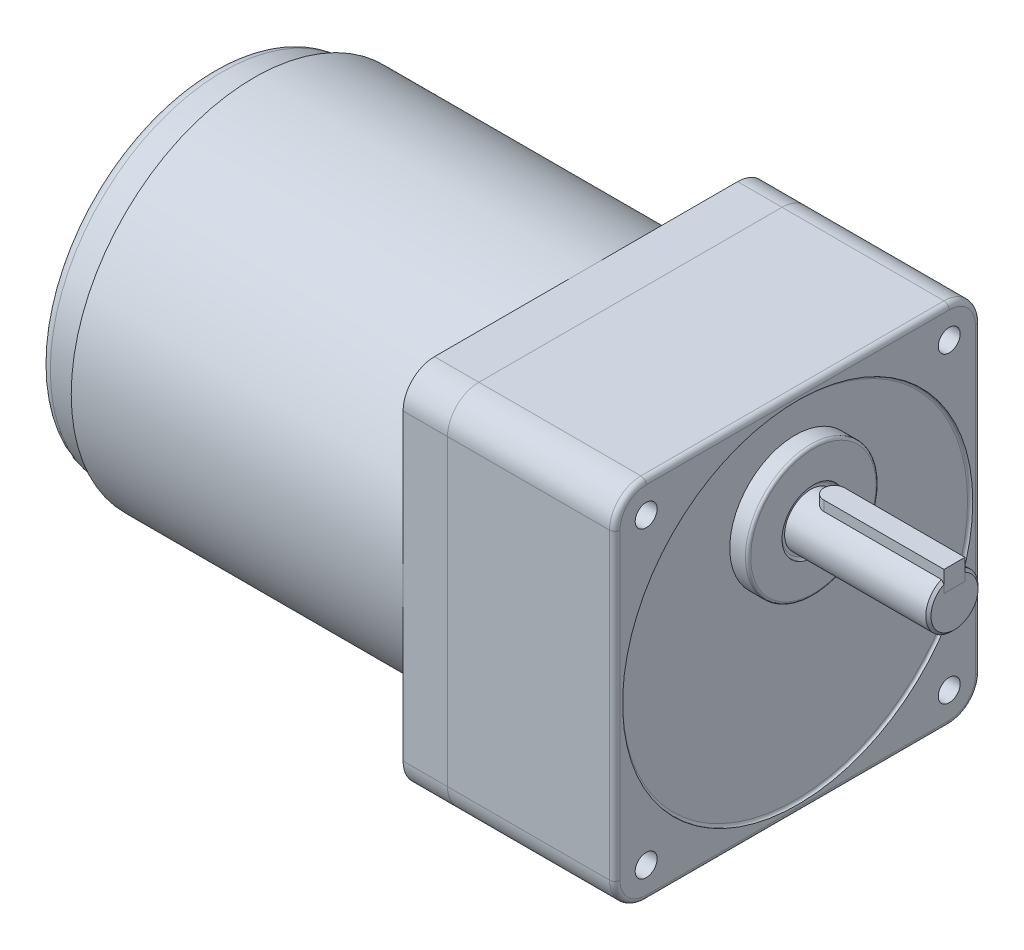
ISO-10303-21;
HEADER;
FILE_DESCRIPTION(('STEP AP214'),'2;1');
FILE_NAME('part.step','',(''),(''),'','','');
FILE_SCHEMA(('AUTOMOTIVE_DESIGN { 1 0 10303 214 1 1 1 1 }'));
ENDSEC;
DATA;
#1=APPLICATION_CONTEXT('core data for automotive mechanical design processes');
#2=APPLICATION_PROTOCOL_DEFINITION('international standard','automotive_design',2000,#1);
#3=PRODUCT_CONTEXT('',#1,'mechanical');
#4=PRODUCT('Part','Part','',(#3));
#5=PRODUCT_RELATED_PRODUCT_CATEGORY('part','',(#4));
#6=PRODUCT_DEFINITION_FORMATION('','',#4);
#7=PRODUCT_DEFINITION_CONTEXT('part definition',#1,'design');
#8=PRODUCT_DEFINITION('design','',#6,#7);
#9=PRODUCT_DEFINITION_SHAPE('','',#8);
#10=(LENGTH_UNIT() NAMED_UNIT(*) SI_UNIT(.MILLI.,.METRE.));
#11=(NAMED_UNIT(*) PLANE_ANGLE_UNIT() SI_UNIT($,.RADIAN.));
#12=(NAMED_UNIT(*) SI_UNIT($,.STERADIAN.) SOLID_ANGLE_UNIT());
#13=UNCERTAINTY_MEASURE_WITH_UNIT(LENGTH_MEASURE(1.E-05),#10,'distance_accuracy_value','');
#14=(GEOMETRIC_REPRESENTATION_CONTEXT(3) GLOBAL_UNCERTAINTY_ASSIGNED_CONTEXT((#13)) GLOBAL_UNIT_ASSIGNED_CONTEXT((#10,
#11,#12)) REPRESENTATION_CONTEXT('',''));
#15=CARTESIAN_POINT('',(0.,0.,0.));
#16=DIRECTION('',(0.,0.,1.));
#17=DIRECTION('',(1.,0.,0.));
#18=AXIS2_PLACEMENT_3D('',#15,#16,#17);
#19=CARTESIAN_POINT('',(7.,21.5,0.));
#20=DIRECTION('',(0.,-1.,0.));
#21=DIRECTION('',(0.,0.,-1.));
#22=AXIS2_PLACEMENT_3D('',#19,#20,#21);
#23=CYLINDRICAL_SURFACE('',#22,2.);
#24=CARTESIAN_POINT('',(7.,17.5,0.));
#25=DIRECTION('',(0.,1.,0.));
#26=DIRECTION('',(0.,0.,1.));
#27=AXIS2_PLACEMENT_3D('',#24,#25,#26);
#28=CIRCLE('',#27,2.);
#29=CARTESIAN_POINT('',(7.,17.5,-2.));
#30=VERTEX_POINT('',#29);
#31=CARTESIAN_POINT('',(7.,17.5,2.));
#32=VERTEX_POINT('',#31);
#33=EDGE_CURVE('E113',#30,#32,#28,.T.);
#34=ORIENTED_EDGE('',*,*,#33,.T.);
#35=DIRECTION('',(0.,-1.,0.));
#36=VECTOR('',#35,1.);
#37=CARTESIAN_POINT('',(7.,21.5,2.));
#38=LINE('',#37,#36);
#39=CARTESIAN_POINT('',(7.,21.5,2.));
#40=VERTEX_POINT('',#39);
#41=EDGE_CURVE('E12',#40,#32,#38,.T.);
#42=ORIENTED_EDGE('',*,*,#41,.F.);
#43=CARTESIAN_POINT('',(7.,21.5,0.));
#44=DIRECTION('',(0.,1.,0.));
#45=DIRECTION('',(0.,0.,1.));
#46=AXIS2_PLACEMENT_3D('',#43,#44,#45);
#47=CIRCLE('',#46,2.);
#48=CARTESIAN_POINT('',(7.,21.5,-2.));
#49=VERTEX_POINT('',#48);
#50=EDGE_CURVE('E101',#49,#40,#47,.T.);
#51=ORIENTED_EDGE('',*,*,#50,.F.);
#52=DIRECTION('',(0.,-1.,0.));
#53=VECTOR('',#52,1.);
#54=CARTESIAN_POINT('',(7.,21.5,-2.));
#55=LINE('',#54,#53);
#56=EDGE_CURVE('E109',#49,#30,#55,.T.);
#57=ORIENTED_EDGE('',*,*,#56,.T.);
#58=EDGE_LOOP('',(#34,#42,#51,#57));
#59=FACE_BOUND('',#58,.T.);
#60=ADVANCED_FACE('F50',(#59),#23,.T.);
#61=CARTESIAN_POINT('',(30.,21.5,2.));
#62=DIRECTION('',(0.,0.,-1.));
#63=DIRECTION('',(-1.,0.,0.));
#64=AXIS2_PLACEMENT_3D('',#61,#62,#63);
#65=PLANE('',#64);
#66=DIRECTION('',(1.,0.,0.));
#67=VECTOR('',#66,1.);
#68=CARTESIAN_POINT('',(30.,17.5,2.));
#69=LINE('',#68,#67);
#70=CARTESIAN_POINT('',(30.,17.5,2.));
#71=VERTEX_POINT('',#70);
#72=EDGE_CURVE('E105',#32,#71,#69,.T.);
#73=ORIENTED_EDGE('',*,*,#72,.T.);
#74=DIRECTION('',(0.,-1.,0.));
#75=VECTOR('',#74,1.);
#76=CARTESIAN_POINT('',(30.,21.5,2.));
#77=LINE('',#76,#75);
#78=CARTESIAN_POINT('',(30.,21.5,2.));
#79=VERTEX_POINT('',#78);
#80=EDGE_CURVE('E58',#79,#71,#77,.T.);
#81=ORIENTED_EDGE('',*,*,#80,.F.);
#82=DIRECTION('',(1.,0.,0.));
#83=VECTOR('',#82,1.);
#84=CARTESIAN_POINT('',(30.,21.5,2.));
#85=LINE('',#84,#83);
#86=EDGE_CURVE('E96',#40,#79,#85,.T.);
#87=ORIENTED_EDGE('',*,*,#86,.F.);
#88=ORIENTED_EDGE('',*,*,#41,.T.);
#89=EDGE_LOOP('',(#73,#81,#87,#88));
#90=FACE_BOUND('',#89,.T.);
#91=ADVANCED_FACE('F104',(#90),#65,.F.);
#92=CARTESIAN_POINT('',(30.,21.5,-2.));
#93=DIRECTION('',(-1.,0.,0.));
#94=DIRECTION('',(0.,0.,1.));
#95=AXIS2_PLACEMENT_3D('',#92,#93,#94);
#96=PLANE('',#95);
#97=DIRECTION('',(0.,0.,-1.));
#98=VECTOR('',#97,1.);
#99=CARTESIAN_POINT('',(30.,17.5,-2.));
#100=LINE('',#99,#98);
#101=CARTESIAN_POINT('',(30.,17.5,-2.));
#102=VERTEX_POINT('',#101);
#103=EDGE_CURVE('E83',#71,#102,#100,.T.);
#104=ORIENTED_EDGE('',*,*,#103,.T.);
#105=DIRECTION('',(0.,-1.,0.));
#106=VECTOR('',#105,1.);
#107=CARTESIAN_POINT('',(30.,21.5,-2.));
#108=LINE('',#107,#106);
#109=CARTESIAN_POINT('',(30.,21.5,-2.));
#110=VERTEX_POINT('',#109);
#111=EDGE_CURVE('E106',#110,#102,#108,.T.);
#112=ORIENTED_EDGE('',*,*,#111,.F.);
#113=DIRECTION('',(0.,0.,-1.));
#114=VECTOR('',#113,1.);
#115=CARTESIAN_POINT('',(30.,21.5,-2.));
#116=LINE('',#115,#114);
#117=EDGE_CURVE('E99',#79,#110,#116,.T.);
#118=ORIENTED_EDGE('',*,*,#117,.F.);
#119=ORIENTED_EDGE('',*,*,#80,.T.);
#120=EDGE_LOOP('',(#104,#112,#118,#119));
#121=FACE_BOUND('',#120,.T.);
#122=ADVANCED_FACE('F107',(#121),#96,.F.);
#123=CARTESIAN_POINT('',(7.,21.5,-2.));
#124=DIRECTION('',(0.,0.,1.));
#125=DIRECTION('',(1.,0.,0.));
#126=AXIS2_PLACEMENT_3D('',#123,#124,#125);
#127=PLANE('',#126);
#128=DIRECTION('',(-1.,0.,0.));
#129=VECTOR('',#128,1.);
#130=CARTESIAN_POINT('',(7.,17.5,-2.));
#131=LINE('',#130,#129);
#132=EDGE_CURVE('E89',#102,#30,#131,.T.);
#133=ORIENTED_EDGE('',*,*,#132,.T.);
#134=ORIENTED_EDGE('',*,*,#56,.F.);
#135=DIRECTION('',(-1.,0.,0.));
#136=VECTOR('',#135,1.);
#137=CARTESIAN_POINT('',(7.,21.5,-2.));
#138=LINE('',#137,#136);
#139=EDGE_CURVE('E66',#110,#49,#138,.T.);
#140=ORIENTED_EDGE('',*,*,#139,.F.);
#141=ORIENTED_EDGE('',*,*,#111,.T.);
#142=EDGE_LOOP('',(#133,#134,#140,#141));
#143=FACE_BOUND('',#142,.T.);
#144=ADVANCED_FACE('F120',(#143),#127,.F.);
#145=CARTESIAN_POINT('',(7.,21.5,0.));
#146=DIRECTION('',(0.,1.,0.));
#147=DIRECTION('',(0.,0.,1.));
#148=AXIS2_PLACEMENT_3D('',#145,#146,#147);
#149=PLANE('',#148);
#150=ORIENTED_EDGE('',*,*,#50,.T.);
#151=ORIENTED_EDGE('',*,*,#86,.T.);
#152=ORIENTED_EDGE('',*,*,#117,.T.);
#153=ORIENTED_EDGE('',*,*,#139,.T.);
#154=EDGE_LOOP('',(#150,#151,#152,#153));
#155=FACE_BOUND('',#154,.T.);
#156=ADVANCED_FACE('F97',(#155),#149,.T.);
#157=CARTESIAN_POINT('',(7.,17.5,0.));
#158=DIRECTION('',(0.,1.,0.));
#159=DIRECTION('',(0.,0.,1.));
#160=AXIS2_PLACEMENT_3D('',#157,#158,#159);
#161=PLANE('',#160);
#162=ORIENTED_EDGE('',*,*,#33,.F.);
#163=ORIENTED_EDGE('',*,*,#132,.F.);
#164=ORIENTED_EDGE('',*,*,#103,.F.);
#165=ORIENTED_EDGE('',*,*,#72,.F.);
#166=EDGE_LOOP('',(#162,#163,#164,#165));
#167=FACE_BOUND('',#166,.T.);
#168=ADVANCED_FACE('F123',(#167),#161,.F.);
#169=CLOSED_SHELL('',(#60,#91,#122,#144,#156,#168));
#170=MANIFOLD_SOLID_BREP('B2',#169);
#171=CARTESIAN_POINT('',(-104.,0.,0.));
#172=DIRECTION('',(-1.,0.,0.));
#173=DIRECTION('',(0.,0.,1.));
#174=AXIS2_PLACEMENT_3D('',#171,#172,#173);
#175=PLANE('',#174);
#176=CARTESIAN_POINT('',(-104.,0.,0.));
#177=DIRECTION('',(-1.,0.,0.));
#178=DIRECTION('',(0.,0.,1.));
#179=AXIS2_PLACEMENT_3D('',#176,#177,#178);
#180=CIRCLE('',#179,35.);
#181=CARTESIAN_POINT('',(-104.,0.,35.));
#182=VERTEX_POINT('',#181);
#183=EDGE_CURVE('E284',#182,#182,#180,.T.);
#184=ORIENTED_EDGE('',*,*,#183,.T.);
#185=EDGE_LOOP('',(#184));
#186=FACE_BOUND('',#185,.T.);
#187=CARTESIAN_POINT('',(-104.,0.,0.));
#188=DIRECTION('',(-1.,0.,0.));
#189=DIRECTION('',(0.,0.,1.));
#190=AXIS2_PLACEMENT_3D('',#187,#188,#189);
#191=CIRCLE('',#190,33.);
#192=CARTESIAN_POINT('',(-104.,0.,33.));
#193=VERTEX_POINT('',#192);
#194=EDGE_CURVE('E285',#193,#193,#191,.T.);
#195=ORIENTED_EDGE('',*,*,#194,.F.);
#196=EDGE_LOOP('',(#195));
#197=FACE_BOUND('',#196,.T.);
#198=ADVANCED_FACE('F183',(#186,#197),#175,.T.);
#199=CARTESIAN_POINT('',(-40.5,29.,29.));
#200=DIRECTION('',(1.,0.,0.));
#201=DIRECTION('',(0.,0.,-1.));
#202=AXIS2_PLACEMENT_3D('',#199,#200,#201);
#203=PLANE('',#202);
#204=CARTESIAN_POINT('',(-40.5,0.,0.));
#205=DIRECTION('',(-1.,0.,0.));
#206=DIRECTION('',(0.,0.,1.));
#207=AXIS2_PLACEMENT_3D('',#204,#205,#206);
#208=CIRCLE('',#207,35.);
#209=CARTESIAN_POINT('',(-40.5,0.,35.));
#210=VERTEX_POINT('',#209);
#211=CARTESIAN_POINT('',(-40.5,35.,0.));
#212=VERTEX_POINT('',#211);
#213=EDGE_CURVE('E279',#210,#212,#208,.T.);
#214=ORIENTED_EDGE('',*,*,#213,.F.);
#215=DIRECTION('',(0.,1.,0.));
#216=VECTOR('',#215,1.);
#217=CARTESIAN_POINT('',(-40.5,-28.9999999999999,35.));
#218=LINE('',#217,#216);
#219=CARTESIAN_POINT('',(-40.5,28.9999999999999,35.));
#220=VERTEX_POINT('',#219);
#221=EDGE_CURVE('E268',#210,#220,#218,.T.);
#222=ORIENTED_EDGE('',*,*,#221,.T.);
#223=CARTESIAN_POINT('',(-40.5,29.,29.));
#224=DIRECTION('',(-1.,0.,0.));
#225=DIRECTION('',(0.,0.,-1.));
#226=AXIS2_PLACEMENT_3D('',#223,#224,#225);
#227=CIRCLE('',#226,6.);
#228=CARTESIAN_POINT('',(-40.5,35.,29.));
#229=VERTEX_POINT('',#228);
#230=EDGE_CURVE('E296',#220,#229,#227,.T.);
#231=ORIENTED_EDGE('',*,*,#230,.T.);
#232=DIRECTION('',(0.,0.,-1.));
#233=VECTOR('',#232,1.);
#234=CARTESIAN_POINT('',(-40.5,35.,-29.));
#235=LINE('',#234,#233);
#236=EDGE_CURVE('E281',#229,#212,#235,.T.);
#237=ORIENTED_EDGE('',*,*,#236,.T.);
#238=EDGE_LOOP('',(#214,#222,#231,#237));
#239=FACE_BOUND('',#238,.T.);
#240=ADVANCED_FACE('F280',(#239),#203,.F.);
#241=CARTESIAN_POINT('',(-40.5,0.,-35.));
#242=VERTEX_POINT('',#241);
#243=EDGE_CURVE('E287',#212,#242,#208,.T.);
#244=ORIENTED_EDGE('',*,*,#243,.F.);
#245=CARTESIAN_POINT('',(-40.5,35.,-29.));
#246=VERTEX_POINT('',#245);
#247=EDGE_CURVE('E298',#212,#246,#235,.T.);
#248=ORIENTED_EDGE('',*,*,#247,.T.);
#249=CARTESIAN_POINT('',(-40.5,29.,-29.));
#250=DIRECTION('',(-1.,0.,0.));
#251=DIRECTION('',(0.,0.,-1.));
#252=AXIS2_PLACEMENT_3D('',#249,#250,#251);
#253=CIRCLE('',#252,6.);
#254=CARTESIAN_POINT('',(-40.5,29.,-35.));
#255=VERTEX_POINT('',#254);
#256=EDGE_CURVE('E301',#246,#255,#253,.T.);
#257=ORIENTED_EDGE('',*,*,#256,.T.);
#258=DIRECTION('',(0.,-1.,0.));
#259=VECTOR('',#258,1.);
#260=CARTESIAN_POINT('',(-40.5,-28.9999999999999,-35.));
#261=LINE('',#260,#259);
#262=EDGE_CURVE('E304',#255,#242,#261,.T.);
#263=ORIENTED_EDGE('',*,*,#262,.T.);
#264=EDGE_LOOP('',(#244,#248,#257,#263));
#265=FACE_BOUND('',#264,.T.);
#266=ADVANCED_FACE('F350',(#265),#203,.F.);
#267=CARTESIAN_POINT('',(-40.5,-35.,0.));
#268=VERTEX_POINT('',#267);
#269=EDGE_CURVE('E206',#242,#268,#208,.T.);
#270=ORIENTED_EDGE('',*,*,#269,.F.);
#271=CARTESIAN_POINT('',(-40.5,-28.9999999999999,-35.));
#272=VERTEX_POINT('',#271);
#273=EDGE_CURVE('E303',#242,#272,#261,.T.);
#274=ORIENTED_EDGE('',*,*,#273,.T.);
#275=CARTESIAN_POINT('',(-40.5,-29.,-29.));
#276=DIRECTION('',(-1.,0.,0.));
#277=DIRECTION('',(0.,0.,-1.));
#278=AXIS2_PLACEMENT_3D('',#275,#276,#277);
#279=CIRCLE('',#278,6.);
#280=CARTESIAN_POINT('',(-40.5,-35.,-29.));
#281=VERTEX_POINT('',#280);
#282=EDGE_CURVE('E307',#272,#281,#279,.T.);
#283=ORIENTED_EDGE('',*,*,#282,.T.);
#284=DIRECTION('',(0.,0.,1.));
#285=VECTOR('',#284,1.);
#286=CARTESIAN_POINT('',(-40.5,-35.,-29.));
#287=LINE('',#286,#285);
#288=EDGE_CURVE('E310',#281,#268,#287,.T.);
#289=ORIENTED_EDGE('',*,*,#288,.T.);
#290=EDGE_LOOP('',(#270,#274,#283,#289));
#291=FACE_BOUND('',#290,.T.);
#292=ADVANCED_FACE('F365',(#291),#203,.F.);
#293=EDGE_CURVE('E198',#268,#210,#208,.T.);
#294=ORIENTED_EDGE('',*,*,#293,.F.);
#295=CARTESIAN_POINT('',(-40.5,-35.,29.));
#296=VERTEX_POINT('',#295);
#297=EDGE_CURVE('E309',#268,#296,#287,.T.);
#298=ORIENTED_EDGE('',*,*,#297,.T.);
#299=CARTESIAN_POINT('',(-40.5,-29.,29.));
#300=DIRECTION('',(-1.,0.,0.));
#301=DIRECTION('',(0.,0.,1.));
#302=AXIS2_PLACEMENT_3D('',#299,#300,#301);
#303=CIRCLE('',#302,6.);
#304=CARTESIAN_POINT('',(-40.5,-29.,35.));
#305=VERTEX_POINT('',#304);
#306=EDGE_CURVE('E263',#296,#305,#303,.T.);
#307=ORIENTED_EDGE('',*,*,#306,.T.);
#308=EDGE_CURVE('E259',#305,#210,#218,.T.);
#309=ORIENTED_EDGE('',*,*,#308,.T.);
#310=EDGE_LOOP('',(#294,#298,#307,#309));
#311=FACE_BOUND('',#310,.T.);
#312=ADVANCED_FACE('F261',(#311),#203,.F.);
#313=CARTESIAN_POINT('',(-40.5,29.,29.));
#314=DIRECTION('',(1.,0.,0.));
#315=DIRECTION('',(0.,0.,-1.));
#316=AXIS2_PLACEMENT_3D('',#313,#314,#315);
#317=CYLINDRICAL_SURFACE('',#316,6.);
#318=CARTESIAN_POINT('',(-32.,29.,29.));
#319=DIRECTION('',(-1.,0.,0.));
#320=DIRECTION('',(0.,0.,-1.));
#321=AXIS2_PLACEMENT_3D('',#318,#319,#320);
#322=CIRCLE('',#321,6.);
#323=CARTESIAN_POINT('',(-32.,28.9999999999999,35.));
#324=VERTEX_POINT('',#323);
#325=CARTESIAN_POINT('',(-32.,35.,29.));
#326=VERTEX_POINT('',#325);
#327=EDGE_CURVE('E313',#324,#326,#322,.T.);
#328=ORIENTED_EDGE('',*,*,#327,.T.);
#329=DIRECTION('',(1.,0.,0.));
#330=VECTOR('',#329,1.);
#331=CARTESIAN_POINT('',(-40.5,35.,29.));
#332=LINE('',#331,#330);
#333=EDGE_CURVE('E289',#229,#326,#332,.T.);
#334=ORIENTED_EDGE('',*,*,#333,.F.);
#335=ORIENTED_EDGE('',*,*,#230,.F.);
#336=DIRECTION('',(1.,0.,0.));
#337=VECTOR('',#336,1.);
#338=CARTESIAN_POINT('',(-40.5,28.9999999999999,35.));
#339=LINE('',#338,#337);
#340=EDGE_CURVE('E267',#220,#324,#339,.T.);
#341=ORIENTED_EDGE('',*,*,#340,.T.);
#342=EDGE_LOOP('',(#328,#334,#335,#341));
#343=FACE_BOUND('',#342,.T.);
#344=ADVANCED_FACE('F384',(#343),#317,.T.);
#345=CARTESIAN_POINT('',(-40.5,35.,-29.));
#346=DIRECTION('',(0.,-1.,0.));
#347=DIRECTION('',(0.,0.,-1.));
#348=AXIS2_PLACEMENT_3D('',#345,#346,#347);
#349=PLANE('',#348);
#350=DIRECTION('',(0.,0.,-1.));
#351=VECTOR('',#350,1.);
#352=CARTESIAN_POINT('',(-32.,35.,-29.));
#353=LINE('',#352,#351);
#354=CARTESIAN_POINT('',(-32.,35.,-29.));
#355=VERTEX_POINT('',#354);
#356=EDGE_CURVE('E316',#326,#355,#353,.T.);
#357=ORIENTED_EDGE('',*,*,#356,.T.);
#358=DIRECTION('',(1.,0.,0.));
#359=VECTOR('',#358,1.);
#360=CARTESIAN_POINT('',(-40.5,35.,-29.));
#361=LINE('',#360,#359);
#362=EDGE_CURVE('E291',#246,#355,#361,.T.);
#363=ORIENTED_EDGE('',*,*,#362,.F.);
#364=ORIENTED_EDGE('',*,*,#247,.F.);
#365=ORIENTED_EDGE('',*,*,#236,.F.);
#366=ORIENTED_EDGE('',*,*,#333,.T.);
#367=EDGE_LOOP('',(#357,#363,#364,#365,#366));
#368=FACE_BOUND('',#367,.T.);
#369=ADVANCED_FACE('F354',(#368),#349,.F.);
#370=CARTESIAN_POINT('',(-40.5,29.,-29.));
#371=DIRECTION('',(1.,0.,0.));
#372=DIRECTION('',(0.,0.,-1.));
#373=AXIS2_PLACEMENT_3D('',#370,#371,#372);
#374=CYLINDRICAL_SURFACE('',#373,6.);
#375=CARTESIAN_POINT('',(-32.,29.,-29.));
#376=DIRECTION('',(-1.,0.,0.));
#377=DIRECTION('',(0.,0.,-1.));
#378=AXIS2_PLACEMENT_3D('',#375,#376,#377);
#379=CIRCLE('',#378,6.);
#380=CARTESIAN_POINT('',(-32.,29.,-35.));
#381=VERTEX_POINT('',#380);
#382=EDGE_CURVE('E318',#355,#381,#379,.T.);
#383=ORIENTED_EDGE('',*,*,#382,.T.);
#384=DIRECTION('',(1.,0.,0.));
#385=VECTOR('',#384,1.);
#386=CARTESIAN_POINT('',(-40.5,29.,-35.));
#387=LINE('',#386,#385);
#388=EDGE_CURVE('E341',#255,#381,#387,.T.);
#389=ORIENTED_EDGE('',*,*,#388,.F.);
#390=ORIENTED_EDGE('',*,*,#256,.F.);
#391=ORIENTED_EDGE('',*,*,#362,.T.);
#392=EDGE_LOOP('',(#383,#389,#390,#391));
#393=FACE_BOUND('',#392,.T.);
#394=ADVANCED_FACE('F359',(#393),#374,.T.);
#395=CARTESIAN_POINT('',(-40.5,-28.9999999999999,-35.));
#396=DIRECTION('',(0.,0.,1.));
#397=DIRECTION('',(1.,0.,0.));
#398=AXIS2_PLACEMENT_3D('',#395,#396,#397);
#399=PLANE('',#398);
#400=DIRECTION('',(0.,-1.,0.));
#401=VECTOR('',#400,1.);
#402=CARTESIAN_POINT('',(-32.,-28.9999999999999,-35.));
#403=LINE('',#402,#401);
#404=CARTESIAN_POINT('',(-32.,-28.9999999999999,-35.));
#405=VERTEX_POINT('',#404);
#406=EDGE_CURVE('E320',#381,#405,#403,.T.);
#407=ORIENTED_EDGE('',*,*,#406,.T.);
#408=DIRECTION('',(1.,0.,0.));
#409=VECTOR('',#408,1.);
#410=CARTESIAN_POINT('',(-40.5,-28.9999999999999,-35.));
#411=LINE('',#410,#409);
#412=EDGE_CURVE('E338',#272,#405,#411,.T.);
#413=ORIENTED_EDGE('',*,*,#412,.F.);
#414=ORIENTED_EDGE('',*,*,#273,.F.);
#415=ORIENTED_EDGE('',*,*,#262,.F.);
#416=ORIENTED_EDGE('',*,*,#388,.T.);
#417=EDGE_LOOP('',(#407,#413,#414,#415,#416));
#418=FACE_BOUND('',#417,.T.);
#419=ADVANCED_FACE('F362',(#418),#399,.F.);
#420=CARTESIAN_POINT('',(-40.5,-29.,-29.));
#421=DIRECTION('',(1.,0.,0.));
#422=DIRECTION('',(0.,0.,-1.));
#423=AXIS2_PLACEMENT_3D('',#420,#421,#422);
#424=CYLINDRICAL_SURFACE('',#423,6.);
#425=CARTESIAN_POINT('',(-32.,-29.,-29.));
#426=DIRECTION('',(-1.,0.,0.));
#427=DIRECTION('',(0.,0.,-1.));
#428=AXIS2_PLACEMENT_3D('',#425,#426,#427);
#429=CIRCLE('',#428,6.);
#430=CARTESIAN_POINT('',(-32.,-35.,-29.));
#431=VERTEX_POINT('',#430);
#432=EDGE_CURVE('E322',#405,#431,#429,.T.);
#433=ORIENTED_EDGE('',*,*,#432,.T.);
#434=DIRECTION('',(1.,0.,0.));
#435=VECTOR('',#434,1.);
#436=CARTESIAN_POINT('',(-40.5,-35.,-29.));
#437=LINE('',#436,#435);
#438=EDGE_CURVE('E335',#281,#431,#437,.T.);
#439=ORIENTED_EDGE('',*,*,#438,.F.);
#440=ORIENTED_EDGE('',*,*,#282,.F.);
#441=ORIENTED_EDGE('',*,*,#412,.T.);
#442=EDGE_LOOP('',(#433,#439,#440,#441));
#443=FACE_BOUND('',#442,.T.);
#444=ADVANCED_FACE('F369',(#443),#424,.T.);
#445=CARTESIAN_POINT('',(-40.5,-35.,-29.));
#446=DIRECTION('',(0.,1.,0.));
#447=DIRECTION('',(0.,0.,1.));
#448=AXIS2_PLACEMENT_3D('',#445,#446,#447);
#449=PLANE('',#448);
#450=DIRECTION('',(0.,0.,1.));
#451=VECTOR('',#450,1.);
#452=CARTESIAN_POINT('',(-32.,-35.,-29.));
#453=LINE('',#452,#451);
#454=CARTESIAN_POINT('',(-32.,-35.,29.));
#455=VERTEX_POINT('',#454);
#456=EDGE_CURVE('E324',#431,#455,#453,.T.);
#457=ORIENTED_EDGE('',*,*,#456,.T.);
#458=DIRECTION('',(1.,0.,0.));
#459=VECTOR('',#458,1.);
#460=CARTESIAN_POINT('',(-40.5,-35.,29.));
#461=LINE('',#460,#459);
#462=EDGE_CURVE('E332',#296,#455,#461,.T.);
#463=ORIENTED_EDGE('',*,*,#462,.F.);
#464=ORIENTED_EDGE('',*,*,#297,.F.);
#465=ORIENTED_EDGE('',*,*,#288,.F.);
#466=ORIENTED_EDGE('',*,*,#438,.T.);
#467=EDGE_LOOP('',(#457,#463,#464,#465,#466));
#468=FACE_BOUND('',#467,.T.);
#469=ADVANCED_FACE('F373',(#468),#449,.F.);
#470=CARTESIAN_POINT('',(-40.5,-29.,29.));
#471=DIRECTION('',(1.,0.,0.));
#472=DIRECTION('',(0.,0.,-1.));
#473=AXIS2_PLACEMENT_3D('',#470,#471,#472);
#474=CYLINDRICAL_SURFACE('',#473,6.);
#475=CARTESIAN_POINT('',(-32.,-29.,29.));
#476=DIRECTION('',(-1.,0.,0.));
#477=DIRECTION('',(0.,0.,1.));
#478=AXIS2_PLACEMENT_3D('',#475,#476,#477);
#479=CIRCLE('',#478,6.);
#480=CARTESIAN_POINT('',(-32.,-29.,35.));
#481=VERTEX_POINT('',#480);
#482=EDGE_CURVE('E326',#455,#481,#479,.T.);
#483=ORIENTED_EDGE('',*,*,#482,.T.);
#484=DIRECTION('',(1.,0.,0.));
#485=VECTOR('',#484,1.);
#486=CARTESIAN_POINT('',(-40.5,-29.,35.));
#487=LINE('',#486,#485);
#488=EDGE_CURVE('E330',#305,#481,#487,.T.);
#489=ORIENTED_EDGE('',*,*,#488,.F.);
#490=ORIENTED_EDGE('',*,*,#306,.F.);
#491=ORIENTED_EDGE('',*,*,#462,.T.);
#492=EDGE_LOOP('',(#483,#489,#490,#491));
#493=FACE_BOUND('',#492,.T.);
#494=ADVANCED_FACE('F377',(#493),#474,.T.);
#495=CARTESIAN_POINT('',(-40.5,-28.9999999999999,35.));
#496=DIRECTION('',(0.,0.,-1.));
#497=DIRECTION('',(-1.,0.,0.));
#498=AXIS2_PLACEMENT_3D('',#495,#496,#497);
#499=PLANE('',#498);
#500=DIRECTION('',(0.,1.,0.));
#501=VECTOR('',#500,1.);
#502=CARTESIAN_POINT('',(-32.,-28.9999999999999,35.));
#503=LINE('',#502,#501);
#504=EDGE_CURVE('E299',#481,#324,#503,.T.);
#505=ORIENTED_EDGE('',*,*,#504,.T.);
#506=ORIENTED_EDGE('',*,*,#340,.F.);
#507=ORIENTED_EDGE('',*,*,#221,.F.);
#508=ORIENTED_EDGE('',*,*,#308,.F.);
#509=ORIENTED_EDGE('',*,*,#488,.T.);
#510=EDGE_LOOP('',(#505,#506,#507,#508,#509));
#511=FACE_BOUND('',#510,.T.);
#512=ADVANCED_FACE('F272',(#511),#499,.F.);
#513=CARTESIAN_POINT('',(-32.,29.,29.));
#514=DIRECTION('',(1.,0.,0.));
#515=DIRECTION('',(0.,0.,-1.));
#516=AXIS2_PLACEMENT_3D('',#513,#514,#515);
#517=PLANE('',#516);
#518=ORIENTED_EDGE('',*,*,#327,.F.);
#519=ORIENTED_EDGE('',*,*,#504,.F.);
#520=ORIENTED_EDGE('',*,*,#482,.F.);
#521=ORIENTED_EDGE('',*,*,#456,.F.);
#522=ORIENTED_EDGE('',*,*,#432,.F.);
#523=ORIENTED_EDGE('',*,*,#406,.F.);
#524=ORIENTED_EDGE('',*,*,#382,.F.);
#525=ORIENTED_EDGE('',*,*,#356,.F.);
#526=EDGE_LOOP('',(#518,#519,#520,#521,#522,#523,#524,#525));
#527=FACE_BOUND('',#526,.T.);
#528=ADVANCED_FACE('F381',(#527),#517,.T.);
#529=CARTESIAN_POINT('',(-104.,0.,0.));
#530=DIRECTION('',(1.,0.,0.));
#531=DIRECTION('',(0.,0.,-1.));
#532=AXIS2_PLACEMENT_3D('',#529,#530,#531);
#533=CYLINDRICAL_SURFACE('',#532,35.);
#534=ORIENTED_EDGE('',*,*,#183,.F.);
#535=EDGE_LOOP('',(#534));
#536=FACE_BOUND('',#535,.T.);
#537=ORIENTED_EDGE('',*,*,#213,.T.);
#538=ORIENTED_EDGE('',*,*,#243,.T.);
#539=ORIENTED_EDGE('',*,*,#269,.T.);
#540=ORIENTED_EDGE('',*,*,#293,.T.);
#541=EDGE_LOOP('',(#537,#538,#539,#540));
#542=FACE_BOUND('',#541,.T.);
#543=ADVANCED_FACE('F288',(#536,#542),#533,.T.);
#544=CARTESIAN_POINT('',(-112.,0.,0.));
#545=DIRECTION('',(1.,0.,0.));
#546=DIRECTION('',(0.,0.,-1.));
#547=AXIS2_PLACEMENT_3D('',#544,#545,#546);
#548=CYLINDRICAL_SURFACE('',#547,33.);
#549=CARTESIAN_POINT('',(-110.,0.,0.));
#550=DIRECTION('',(-1.,0.,0.));
#551=DIRECTION('',(0.,0.,1.));
#552=AXIS2_PLACEMENT_3D('',#549,#550,#551);
#553=CIRCLE('',#552,33.);
#554=CARTESIAN_POINT('',(-110.,0.,33.));
#555=VERTEX_POINT('',#554);
#556=EDGE_CURVE('E48',#555,#555,#553,.F.);
#557=ORIENTED_EDGE('',*,*,#556,.T.);
#558=EDGE_LOOP('',(#557));
#559=FACE_BOUND('',#558,.T.);
#560=ORIENTED_EDGE('',*,*,#194,.T.);
#561=EDGE_LOOP('',(#560));
#562=FACE_BOUND('',#561,.T.);
#563=ADVANCED_FACE('F402',(#559,#562),#548,.T.);
#564=CARTESIAN_POINT('',(-112.,0.,0.));
#565=DIRECTION('',(-1.,0.,0.));
#566=DIRECTION('',(0.,0.,1.));
#567=AXIS2_PLACEMENT_3D('',#564,#565,#566);
#568=PLANE('',#567);
#569=CARTESIAN_POINT('',(-112.,0.,0.));
#570=DIRECTION('',(-1.,0.,0.));
#571=DIRECTION('',(0.,0.,1.));
#572=AXIS2_PLACEMENT_3D('',#569,#570,#571);
#573=CIRCLE('',#572,31.);
#574=CARTESIAN_POINT('',(-112.,0.,31.));
#575=VERTEX_POINT('',#574);
#576=EDGE_CURVE('E191',#575,#575,#573,.T.);
#577=ORIENTED_EDGE('',*,*,#576,.T.);
#578=EDGE_LOOP('',(#577));
#579=FACE_BOUND('',#578,.T.);
#580=ADVANCED_FACE('F459',(#579),#568,.T.);
#581=CARTESIAN_POINT('',(-110.,0.,0.));
#582=DIRECTION('',(-1.,0.,0.));
#583=DIRECTION('',(0.,0.,1.));
#584=AXIS2_PLACEMENT_3D('',#581,#582,#583);
#585=TOROIDAL_SURFACE('',#584,31.,2.);
#586=ORIENTED_EDGE('',*,*,#556,.F.);
#587=EDGE_LOOP('',(#586));
#588=FACE_BOUND('',#587,.T.);
#589=ORIENTED_EDGE('',*,*,#576,.F.);
#590=EDGE_LOOP('',(#589));
#591=FACE_BOUND('',#590,.T.);
#592=ADVANCED_FACE('F185',(#588,#591),#585,.T.);
#593=CLOSED_SHELL('',(#198,#240,#266,#292,#312,#344,#369,#394,#419,#444,#469,#494,#512,#528,
#543,#563,#580,#592));
#594=MANIFOLD_SOLID_BREP('B6',#593);
#595=CARTESIAN_POINT('',(2.5,15.,0.));
#596=DIRECTION('',(1.,0.,0.));
#597=DIRECTION('',(0.,0.,-1.));
#598=AXIS2_PLACEMENT_3D('',#595,#596,#597);
#599=PLANE('',#598);
#600=CARTESIAN_POINT('',(2.5,15.,0.));
#601=DIRECTION('',(1.,0.,0.));
#602=DIRECTION('',(0.,0.,-1.));
#603=AXIS2_PLACEMENT_3D('',#600,#601,#602);
#604=CIRCLE('',#603,5.5);
#605=CARTESIAN_POINT('',(2.5,15.,-5.5));
#606=VERTEX_POINT('',#605);
#607=EDGE_CURVE('E861',#606,#606,#604,.T.);
#608=ORIENTED_EDGE('',*,*,#607,.T.);
#609=EDGE_LOOP('',(#608));
#610=FACE_BOUND('',#609,.T.);
#611=CARTESIAN_POINT('',(2.5,15.,0.));
#612=DIRECTION('',(1.,0.,0.));
#613=DIRECTION('',(0.,0.,-1.));
#614=AXIS2_PLACEMENT_3D('',#611,#612,#613);
#615=CIRCLE('',#614,5.);
#616=CARTESIAN_POINT('',(2.5,15.,-5.));
#617=VERTEX_POINT('',#616);
#618=EDGE_CURVE('E712',#617,#617,#615,.T.);
#619=ORIENTED_EDGE('',*,*,#618,.F.);
#620=EDGE_LOOP('',(#619));
#621=FACE_BOUND('',#620,.T.);
#622=ADVANCED_FACE('F541',(#610,#621),#599,.T.);
#623=CARTESIAN_POINT('',(-0.5,0.,0.));
#624=DIRECTION('',(1.,0.,0.));
#625=DIRECTION('',(0.,0.,-1.));
#626=AXIS2_PLACEMENT_3D('',#623,#624,#625);
#627=PLANE('',#626);
#628=CARTESIAN_POINT('',(-0.5,0.,0.));
#629=DIRECTION('',(1.,0.,0.));
#630=DIRECTION('',(0.,0.,-1.));
#631=AXIS2_PLACEMENT_3D('',#628,#629,#630);
#632=CIRCLE('',#631,33.);
#633=CARTESIAN_POINT('',(-0.5,0.,-33.));
#634=VERTEX_POINT('',#633);
#635=EDGE_CURVE('E832',#634,#634,#632,.T.);
#636=ORIENTED_EDGE('',*,*,#635,.T.);
#637=EDGE_LOOP('',(#636));
#638=FACE_BOUND('',#637,.T.);
#639=CARTESIAN_POINT('',(-0.5,15.,0.));
#640=DIRECTION('',(1.,0.,0.));
#641=DIRECTION('',(0.,0.,-1.));
#642=AXIS2_PLACEMENT_3D('',#639,#640,#641);
#643=CIRCLE('',#642,12.5);
#644=CARTESIAN_POINT('',(-0.5,15.,-12.5));
#645=VERTEX_POINT('',#644);
#646=EDGE_CURVE('E718',#645,#645,#643,.T.);
#647=ORIENTED_EDGE('',*,*,#646,.F.);
#648=EDGE_LOOP('',(#647));
#649=FACE_BOUND('',#648,.T.);
#650=ADVANCED_FACE('F889',(#638,#649),#627,.T.);
#651=CARTESIAN_POINT('',(-32.,-29.,29.));
#652=DIRECTION('',(1.,0.,0.));
#653=DIRECTION('',(0.,0.,-1.));
#654=AXIS2_PLACEMENT_3D('',#651,#652,#653);
#655=CYLINDRICAL_SURFACE('',#654,6.);
#656=DIRECTION('',(1.,0.,0.));
#657=VECTOR('',#656,1.);
#658=CARTESIAN_POINT('',(-32.,-35.,29.));
#659=LINE('',#658,#657);
#660=CARTESIAN_POINT('',(-32.,-35.,29.));
#661=VERTEX_POINT('',#660);
#662=CARTESIAN_POINT('',(-1.,-35.,29.));
#663=VERTEX_POINT('',#662);
#664=EDGE_CURVE('E774',#661,#663,#659,.T.);
#665=ORIENTED_EDGE('',*,*,#664,.T.);
#666=CARTESIAN_POINT('',(-1.,-29.,29.));
#667=DIRECTION('',(-1.,0.,0.));
#668=DIRECTION('',(0.,0.,1.));
#669=AXIS2_PLACEMENT_3D('',#666,#667,#668);
#670=CIRCLE('',#669,6.);
#671=CARTESIAN_POINT('',(-1.,-29.,35.));
#672=VERTEX_POINT('',#671);
#673=EDGE_CURVE('E830',#663,#672,#670,.T.);
#674=ORIENTED_EDGE('',*,*,#673,.T.);
#675=DIRECTION('',(1.,0.,0.));
#676=VECTOR('',#675,1.);
#677=CARTESIAN_POINT('',(-32.,-29.,35.));
#678=LINE('',#677,#676);
#679=CARTESIAN_POINT('',(-32.,-29.,35.));
#680=VERTEX_POINT('',#679);
#681=EDGE_CURVE('E775',#680,#672,#678,.T.);
#682=ORIENTED_EDGE('',*,*,#681,.F.);
#683=CARTESIAN_POINT('',(-32.,-29.,29.));
#684=DIRECTION('',(1.,0.,0.));
#685=DIRECTION('',(0.,0.,1.));
#686=AXIS2_PLACEMENT_3D('',#683,#684,#685);
#687=CIRCLE('',#686,6.);
#688=EDGE_CURVE('E749',#680,#661,#687,.T.);
#689=ORIENTED_EDGE('',*,*,#688,.T.);
#690=EDGE_LOOP('',(#665,#674,#682,#689));
#691=FACE_BOUND('',#690,.T.);
#692=ADVANCED_FACE('F894',(#691),#655,.T.);
#693=CARTESIAN_POINT('',(-32.,-29.,35.));
#694=DIRECTION('',(0.,0.,1.));
#695=DIRECTION('',(1.,0.,0.));
#696=AXIS2_PLACEMENT_3D('',#693,#694,#695);
#697=PLANE('',#696);
#698=ORIENTED_EDGE('',*,*,#681,.T.);
#699=DIRECTION('',(0.,-1.,0.));
#700=VECTOR('',#699,1.);
#701=CARTESIAN_POINT('',(-1.,29.,35.));
#702=LINE('',#701,#700);
#703=CARTESIAN_POINT('',(-1.,29.,35.));
#704=VERTEX_POINT('',#703);
#705=EDGE_CURVE('E815',#672,#704,#702,.F.);
#706=ORIENTED_EDGE('',*,*,#705,.T.);
#707=DIRECTION('',(1.,0.,0.));
#708=VECTOR('',#707,1.);
#709=CARTESIAN_POINT('',(-32.,29.,35.));
#710=LINE('',#709,#708);
#711=CARTESIAN_POINT('',(-32.,29.,35.));
#712=VERTEX_POINT('',#711);
#713=EDGE_CURVE('E779',#712,#704,#710,.T.);
#714=ORIENTED_EDGE('',*,*,#713,.F.);
#715=DIRECTION('',(0.,-1.,0.));
#716=VECTOR('',#715,1.);
#717=CARTESIAN_POINT('',(-32.,-29.,35.));
#718=LINE('',#717,#716);
#719=EDGE_CURVE('E771',#712,#680,#718,.T.);
#720=ORIENTED_EDGE('',*,*,#719,.T.);
#721=EDGE_LOOP('',(#698,#706,#714,#720));
#722=FACE_BOUND('',#721,.T.);
#723=ADVANCED_FACE('F952',(#722),#697,.T.);
#724=CARTESIAN_POINT('',(-32.,29.,29.));
#725=DIRECTION('',(1.,0.,0.));
#726=DIRECTION('',(0.,0.,-1.));
#727=AXIS2_PLACEMENT_3D('',#724,#725,#726);
#728=CYLINDRICAL_SURFACE('',#727,6.);
#729=ORIENTED_EDGE('',*,*,#713,.T.);
#730=CARTESIAN_POINT('',(-1.,29.,29.));
#731=DIRECTION('',(-1.,0.,0.));
#732=DIRECTION('',(0.,0.,1.));
#733=AXIS2_PLACEMENT_3D('',#730,#731,#732);
#734=CIRCLE('',#733,6.);
#735=CARTESIAN_POINT('',(-1.,35.,29.));
#736=VERTEX_POINT('',#735);
#737=EDGE_CURVE('E818',#704,#736,#734,.T.);
#738=ORIENTED_EDGE('',*,*,#737,.T.);
#739=DIRECTION('',(1.,0.,0.));
#740=VECTOR('',#739,1.);
#741=CARTESIAN_POINT('',(-32.,35.,29.));
#742=LINE('',#741,#740);
#743=CARTESIAN_POINT('',(-32.,35.,29.));
#744=VERTEX_POINT('',#743);
#745=EDGE_CURVE('E782',#744,#736,#742,.T.);
#746=ORIENTED_EDGE('',*,*,#745,.F.);
#747=CARTESIAN_POINT('',(-32.,29.,29.));
#748=DIRECTION('',(1.,0.,0.));
#749=DIRECTION('',(0.,0.,1.));
#750=AXIS2_PLACEMENT_3D('',#747,#748,#749);
#751=CIRCLE('',#750,6.);
#752=EDGE_CURVE('E768',#744,#712,#751,.T.);
#753=ORIENTED_EDGE('',*,*,#752,.T.);
#754=EDGE_LOOP('',(#729,#738,#746,#753));
#755=FACE_BOUND('',#754,.T.);
#756=ADVANCED_FACE('F955',(#755),#728,.T.);
#757=CARTESIAN_POINT('',(-32.,35.,29.));
#758=DIRECTION('',(0.,1.,0.));
#759=DIRECTION('',(0.,0.,1.));
#760=AXIS2_PLACEMENT_3D('',#757,#758,#759);
#761=PLANE('',#760);
#762=ORIENTED_EDGE('',*,*,#745,.T.);
#763=DIRECTION('',(0.,0.,1.));
#764=VECTOR('',#763,1.);
#765=CARTESIAN_POINT('',(-1.,35.,-29.));
#766=LINE('',#765,#764);
#767=CARTESIAN_POINT('',(-1.,35.,-29.));
#768=VERTEX_POINT('',#767);
#769=EDGE_CURVE('E820',#736,#768,#766,.F.);
#770=ORIENTED_EDGE('',*,*,#769,.T.);
#771=DIRECTION('',(1.,0.,0.));
#772=VECTOR('',#771,1.);
#773=CARTESIAN_POINT('',(-32.,35.,-29.));
#774=LINE('',#773,#772);
#775=CARTESIAN_POINT('',(-32.,35.,-29.));
#776=VERTEX_POINT('',#775);
#777=EDGE_CURVE('E785',#776,#768,#774,.T.);
#778=ORIENTED_EDGE('',*,*,#777,.F.);
#779=DIRECTION('',(0.,0.,1.));
#780=VECTOR('',#779,1.);
#781=CARTESIAN_POINT('',(-32.,35.,29.));
#782=LINE('',#781,#780);
#783=EDGE_CURVE('E765',#776,#744,#782,.T.);
#784=ORIENTED_EDGE('',*,*,#783,.T.);
#785=EDGE_LOOP('',(#762,#770,#778,#784));
#786=FACE_BOUND('',#785,.T.);
#787=ADVANCED_FACE('F959',(#786),#761,.T.);
#788=CARTESIAN_POINT('',(-32.,29.,-29.));
#789=DIRECTION('',(1.,0.,0.));
#790=DIRECTION('',(0.,0.,-1.));
#791=AXIS2_PLACEMENT_3D('',#788,#789,#790);
#792=CYLINDRICAL_SURFACE('',#791,6.);
#793=ORIENTED_EDGE('',*,*,#777,.T.);
#794=CARTESIAN_POINT('',(-1.,29.,-29.));
#795=DIRECTION('',(-1.,0.,0.));
#796=DIRECTION('',(0.,0.,1.));
#797=AXIS2_PLACEMENT_3D('',#794,#795,#796);
#798=CIRCLE('',#797,6.);
#799=CARTESIAN_POINT('',(-1.,28.9999999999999,-35.));
#800=VERTEX_POINT('',#799);
#801=EDGE_CURVE('E822',#768,#800,#798,.T.);
#802=ORIENTED_EDGE('',*,*,#801,.T.);
#803=DIRECTION('',(1.,0.,0.));
#804=VECTOR('',#803,1.);
#805=CARTESIAN_POINT('',(-32.,28.9999999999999,-35.));
#806=LINE('',#805,#804);
#807=CARTESIAN_POINT('',(-32.,28.9999999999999,-35.));
#808=VERTEX_POINT('',#807);
#809=EDGE_CURVE('E788',#808,#800,#806,.T.);
#810=ORIENTED_EDGE('',*,*,#809,.F.);
#811=CARTESIAN_POINT('',(-32.,29.,-29.));
#812=DIRECTION('',(1.,0.,0.));
#813=DIRECTION('',(0.,0.,1.));
#814=AXIS2_PLACEMENT_3D('',#811,#812,#813);
#815=CIRCLE('',#814,6.);
#816=EDGE_CURVE('E762',#808,#776,#815,.T.);
#817=ORIENTED_EDGE('',*,*,#816,.T.);
#818=EDGE_LOOP('',(#793,#802,#810,#817));
#819=FACE_BOUND('',#818,.T.);
#820=ADVANCED_FACE('F963',(#819),#792,.T.);
#821=CARTESIAN_POINT('',(-32.,-29.,-35.));
#822=DIRECTION('',(0.,0.,-1.));
#823=DIRECTION('',(-1.,0.,0.));
#824=AXIS2_PLACEMENT_3D('',#821,#822,#823);
#825=PLANE('',#824);
#826=ORIENTED_EDGE('',*,*,#809,.T.);
#827=DIRECTION('',(0.,1.,0.));
#828=VECTOR('',#827,1.);
#829=CARTESIAN_POINT('',(-1.,-29.,-35.));
#830=LINE('',#829,#828);
#831=CARTESIAN_POINT('',(-1.,-29.,-35.));
#832=VERTEX_POINT('',#831);
#833=EDGE_CURVE('E824',#800,#832,#830,.F.);
#834=ORIENTED_EDGE('',*,*,#833,.T.);
#835=DIRECTION('',(1.,0.,0.));
#836=VECTOR('',#835,1.);
#837=CARTESIAN_POINT('',(-32.,-29.,-35.));
#838=LINE('',#837,#836);
#839=CARTESIAN_POINT('',(-32.,-29.,-35.));
#840=VERTEX_POINT('',#839);
#841=EDGE_CURVE('E791',#840,#832,#838,.T.);
#842=ORIENTED_EDGE('',*,*,#841,.F.);
#843=DIRECTION('',(0.,1.,0.));
#844=VECTOR('',#843,1.);
#845=CARTESIAN_POINT('',(-32.,-29.,-35.));
#846=LINE('',#845,#844);
#847=EDGE_CURVE('E759',#840,#808,#846,.T.);
#848=ORIENTED_EDGE('',*,*,#847,.T.);
#849=EDGE_LOOP('',(#826,#834,#842,#848));
#850=FACE_BOUND('',#849,.T.);
#851=ADVANCED_FACE('F967',(#850),#825,.T.);
#852=CARTESIAN_POINT('',(-32.,-29.,-29.));
#853=DIRECTION('',(1.,0.,0.));
#854=DIRECTION('',(0.,0.,-1.));
#855=AXIS2_PLACEMENT_3D('',#852,#853,#854);
#856=CYLINDRICAL_SURFACE('',#855,6.);
#857=ORIENTED_EDGE('',*,*,#841,.T.);
#858=CARTESIAN_POINT('',(-1.,-29.,-29.));
#859=DIRECTION('',(-1.,0.,0.));
#860=DIRECTION('',(0.,0.,1.));
#861=AXIS2_PLACEMENT_3D('',#858,#859,#860);
#862=CIRCLE('',#861,6.);
#863=CARTESIAN_POINT('',(-1.,-35.,-29.));
#864=VERTEX_POINT('',#863);
#865=EDGE_CURVE('E826',#832,#864,#862,.T.);
#866=ORIENTED_EDGE('',*,*,#865,.T.);
#867=DIRECTION('',(1.,0.,0.));
#868=VECTOR('',#867,1.);
#869=CARTESIAN_POINT('',(-32.,-35.,-29.));
#870=LINE('',#869,#868);
#871=CARTESIAN_POINT('',(-32.,-35.,-29.));
#872=VERTEX_POINT('',#871);
#873=EDGE_CURVE('E794',#872,#864,#870,.T.);
#874=ORIENTED_EDGE('',*,*,#873,.F.);
#875=CARTESIAN_POINT('',(-32.,-29.,-29.));
#876=DIRECTION('',(1.,0.,0.));
#877=DIRECTION('',(0.,0.,-1.));
#878=AXIS2_PLACEMENT_3D('',#875,#876,#877);
#879=CIRCLE('',#878,6.);
#880=EDGE_CURVE('E756',#872,#840,#879,.T.);
#881=ORIENTED_EDGE('',*,*,#880,.T.);
#882=EDGE_LOOP('',(#857,#866,#874,#881));
#883=FACE_BOUND('',#882,.T.);
#884=ADVANCED_FACE('F971',(#883),#856,.T.);
#885=CARTESIAN_POINT('',(-32.,-35.,29.));
#886=DIRECTION('',(0.,-1.,0.));
#887=DIRECTION('',(0.,0.,-1.));
#888=AXIS2_PLACEMENT_3D('',#885,#886,#887);
#889=PLANE('',#888);
#890=ORIENTED_EDGE('',*,*,#873,.T.);
#891=DIRECTION('',(0.,0.,-1.));
#892=VECTOR('',#891,1.);
#893=CARTESIAN_POINT('',(-1.,-35.,29.));
#894=LINE('',#893,#892);
#895=EDGE_CURVE('E828',#864,#663,#894,.F.);
#896=ORIENTED_EDGE('',*,*,#895,.T.);
#897=ORIENTED_EDGE('',*,*,#664,.F.);
#898=DIRECTION('',(0.,0.,-1.));
#899=VECTOR('',#898,1.);
#900=CARTESIAN_POINT('',(-32.,-35.,29.));
#901=LINE('',#900,#899);
#902=EDGE_CURVE('E752',#661,#872,#901,.T.);
#903=ORIENTED_EDGE('',*,*,#902,.T.);
#904=EDGE_LOOP('',(#890,#896,#897,#903));
#905=FACE_BOUND('',#904,.T.);
#906=ADVANCED_FACE('F946',(#905),#889,.T.);
#907=CARTESIAN_POINT('',(-32.,-29.,29.));
#908=DIRECTION('',(-1.,0.,0.));
#909=DIRECTION('',(0.,0.,1.));
#910=AXIS2_PLACEMENT_3D('',#907,#908,#909);
#911=PLANE('',#910);
#912=ORIENTED_EDGE('',*,*,#688,.F.);
#913=ORIENTED_EDGE('',*,*,#719,.F.);
#914=ORIENTED_EDGE('',*,*,#752,.F.);
#915=ORIENTED_EDGE('',*,*,#783,.F.);
#916=ORIENTED_EDGE('',*,*,#816,.F.);
#917=ORIENTED_EDGE('',*,*,#847,.F.);
#918=ORIENTED_EDGE('',*,*,#880,.F.);
#919=ORIENTED_EDGE('',*,*,#902,.F.);
#920=EDGE_LOOP('',(#912,#913,#914,#915,#916,#917,#918,#919));
#921=FACE_BOUND('',#920,.T.);
#922=ADVANCED_FACE('F942',(#921),#911,.T.);
#923=CARTESIAN_POINT('',(0.,-29.,29.));
#924=DIRECTION('',(-1.,0.,0.));
#925=DIRECTION('',(0.,0.,1.));
#926=AXIS2_PLACEMENT_3D('',#923,#924,#925);
#927=PLANE('',#926);
#928=CARTESIAN_POINT('',(0.,0.,0.));
#929=DIRECTION('',(1.,0.,0.));
#930=DIRECTION('',(0.,0.,-1.));
#931=AXIS2_PLACEMENT_3D('',#928,#929,#930);
#932=CIRCLE('',#931,33.5);
#933=CARTESIAN_POINT('',(0.,0.,-33.5));
#934=VERTEX_POINT('',#933);
#935=EDGE_CURVE('E721',#934,#934,#932,.T.);
#936=ORIENTED_EDGE('',*,*,#935,.F.);
#937=EDGE_LOOP('',(#936));
#938=FACE_BOUND('',#937,.T.);
#939=CARTESIAN_POINT('',(0.,28.9913780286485,28.9913780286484));
#940=DIRECTION('',(1.,0.,0.));
#941=DIRECTION('',(0.,0.,-1.));
#942=AXIS2_PLACEMENT_3D('',#939,#940,#941);
#943=CIRCLE('',#942,2.1);
#944=CARTESIAN_POINT('',(0.,28.9913780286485,26.8913780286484));
#945=VERTEX_POINT('',#944);
#946=EDGE_CURVE('E724',#945,#945,#943,.T.);
#947=ORIENTED_EDGE('',*,*,#946,.F.);
#948=EDGE_LOOP('',(#947));
#949=FACE_BOUND('',#948,.T.);
#950=CARTESIAN_POINT('',(0.,28.9913780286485,-28.9913780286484));
#951=DIRECTION('',(1.,0.,0.));
#952=DIRECTION('',(0.,0.,-1.));
#953=AXIS2_PLACEMENT_3D('',#950,#951,#952);
#954=CIRCLE('',#953,2.1);
#955=CARTESIAN_POINT('',(0.,28.9913780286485,-31.0913780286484));
#956=VERTEX_POINT('',#955);
#957=EDGE_CURVE('E730',#956,#956,#954,.T.);
#958=ORIENTED_EDGE('',*,*,#957,.F.);
#959=EDGE_LOOP('',(#958));
#960=FACE_BOUND('',#959,.T.);
#961=CARTESIAN_POINT('',(0.,-28.9913780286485,-28.9913780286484));
#962=DIRECTION('',(1.,0.,0.));
#963=DIRECTION('',(0.,0.,-1.));
#964=AXIS2_PLACEMENT_3D('',#961,#962,#963);
#965=CIRCLE('',#964,2.1);
#966=CARTESIAN_POINT('',(0.,-28.9913780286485,-31.0913780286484));
#967=VERTEX_POINT('',#966);
#968=EDGE_CURVE('E736',#967,#967,#965,.T.);
#969=ORIENTED_EDGE('',*,*,#968,.F.);
#970=EDGE_LOOP('',(#969));
#971=FACE_BOUND('',#970,.T.);
#972=CARTESIAN_POINT('',(0.,-28.9913780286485,28.9913780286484));
#973=DIRECTION('',(1.,0.,0.));
#974=DIRECTION('',(0.,0.,-1.));
#975=AXIS2_PLACEMENT_3D('',#972,#973,#974);
#976=CIRCLE('',#975,2.1);
#977=CARTESIAN_POINT('',(0.,-28.9913780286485,26.8913780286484));
#978=VERTEX_POINT('',#977);
#979=EDGE_CURVE('E742',#978,#978,#976,.T.);
#980=ORIENTED_EDGE('',*,*,#979,.F.);
#981=EDGE_LOOP('',(#980));
#982=FACE_BOUND('',#981,.T.);
#983=CARTESIAN_POINT('',(0.,29.,29.));
#984=DIRECTION('',(-1.,0.,0.));
#985=DIRECTION('',(0.,0.,1.));
#986=AXIS2_PLACEMENT_3D('',#983,#984,#985);
#987=CIRCLE('',#986,5.);
#988=CARTESIAN_POINT('',(0.,34.,29.));
#989=VERTEX_POINT('',#988);
#990=CARTESIAN_POINT('',(0.,29.,34.));
#991=VERTEX_POINT('',#990);
#992=EDGE_CURVE('E810',#989,#991,#987,.F.);
#993=ORIENTED_EDGE('',*,*,#992,.T.);
#994=DIRECTION('',(0.,-1.,0.));
#995=VECTOR('',#994,1.);
#996=CARTESIAN_POINT('',(0.,-29.,34.));
#997=LINE('',#996,#995);
#998=CARTESIAN_POINT('',(0.,-29.,34.));
#999=VERTEX_POINT('',#998);
#1000=EDGE_CURVE('E812',#991,#999,#997,.T.);
#1001=ORIENTED_EDGE('',*,*,#1000,.T.);
#1002=CARTESIAN_POINT('',(0.,-29.,29.));
#1003=DIRECTION('',(-1.,0.,0.));
#1004=DIRECTION('',(0.,0.,1.));
#1005=AXIS2_PLACEMENT_3D('',#1002,#1003,#1004);
#1006=CIRCLE('',#1005,5.);
#1007=CARTESIAN_POINT('',(0.,-34.,29.));
#1008=VERTEX_POINT('',#1007);
#1009=EDGE_CURVE('E778',#999,#1008,#1006,.F.);
#1010=ORIENTED_EDGE('',*,*,#1009,.T.);
#1011=DIRECTION('',(0.,0.,-1.));
#1012=VECTOR('',#1011,1.);
#1013=CARTESIAN_POINT('',(0.,-34.,-29.));
#1014=LINE('',#1013,#1012);
#1015=CARTESIAN_POINT('',(0.,-34.,-29.));
#1016=VERTEX_POINT('',#1015);
#1017=EDGE_CURVE('E800',#1008,#1016,#1014,.T.);
#1018=ORIENTED_EDGE('',*,*,#1017,.T.);
#1019=CARTESIAN_POINT('',(0.,-29.,-29.));
#1020=DIRECTION('',(-1.,0.,0.));
#1021=DIRECTION('',(0.,0.,1.));
#1022=AXIS2_PLACEMENT_3D('',#1019,#1020,#1021);
#1023=CIRCLE('',#1022,5.);
#1024=CARTESIAN_POINT('',(0.,-29.,-34.));
#1025=VERTEX_POINT('',#1024);
#1026=EDGE_CURVE('E802',#1016,#1025,#1023,.F.);
#1027=ORIENTED_EDGE('',*,*,#1026,.T.);
#1028=DIRECTION('',(0.,1.,0.));
#1029=VECTOR('',#1028,1.);
#1030=CARTESIAN_POINT('',(0.,29.,-34.));
#1031=LINE('',#1030,#1029);
#1032=CARTESIAN_POINT('',(0.,29.,-34.));
#1033=VERTEX_POINT('',#1032);
#1034=EDGE_CURVE('E804',#1025,#1033,#1031,.T.);
#1035=ORIENTED_EDGE('',*,*,#1034,.T.);
#1036=CARTESIAN_POINT('',(0.,29.,-29.));
#1037=DIRECTION('',(-1.,0.,0.));
#1038=DIRECTION('',(0.,0.,1.));
#1039=AXIS2_PLACEMENT_3D('',#1036,#1037,#1038);
#1040=CIRCLE('',#1039,5.);
#1041=CARTESIAN_POINT('',(0.,34.,-29.));
#1042=VERTEX_POINT('',#1041);
#1043=EDGE_CURVE('E806',#1033,#1042,#1040,.F.);
#1044=ORIENTED_EDGE('',*,*,#1043,.T.);
#1045=DIRECTION('',(0.,0.,1.));
#1046=VECTOR('',#1045,1.);
#1047=CARTESIAN_POINT('',(0.,34.,29.));
#1048=LINE('',#1047,#1046);
#1049=EDGE_CURVE('E808',#1042,#989,#1048,.T.);
#1050=ORIENTED_EDGE('',*,*,#1049,.T.);
#1051=EDGE_LOOP('',(#993,#1001,#1010,#1018,#1027,#1035,#1044,#1050));
#1052=FACE_BOUND('',#1051,.T.);
#1053=ADVANCED_FACE('F945',(#938,#949,#960,#971,#982,#1052),#927,.F.);
#1054=CARTESIAN_POINT('',(-1.,-29.,-34.));
#1055=DIRECTION('',(0.,-1.,0.));
#1056=DIRECTION('',(0.,0.,-1.));
#1057=AXIS2_PLACEMENT_3D('',#1054,#1055,#1056);
#1058=CYLINDRICAL_SURFACE('',#1057,1.);
#1059=CARTESIAN_POINT('',(-1.,-29.,-34.));
#1060=DIRECTION('',(0.,-1.,0.));
#1061=DIRECTION('',(0.,0.,-1.));
#1062=AXIS2_PLACEMENT_3D('',#1059,#1060,#1061);
#1063=CIRCLE('',#1062,1.);
#1064=EDGE_CURVE('E848',#832,#1025,#1063,.T.);
#1065=ORIENTED_EDGE('',*,*,#1064,.F.);
#1066=ORIENTED_EDGE('',*,*,#833,.F.);
#1067=CARTESIAN_POINT('',(-1.,29.,-34.));
#1068=DIRECTION('',(0.,1.,0.));
#1069=DIRECTION('',(0.,0.,1.));
#1070=AXIS2_PLACEMENT_3D('',#1067,#1068,#1069);
#1071=CIRCLE('',#1070,1.);
#1072=EDGE_CURVE('E753',#1033,#800,#1071,.T.);
#1073=ORIENTED_EDGE('',*,*,#1072,.F.);
#1074=ORIENTED_EDGE('',*,*,#1034,.F.);
#1075=EDGE_LOOP('',(#1065,#1066,#1073,#1074));
#1076=FACE_BOUND('',#1075,.T.);
#1077=ADVANCED_FACE('F950',(#1076),#1058,.T.);
#1078=CARTESIAN_POINT('',(-1.,29.,-29.));
#1079=DIRECTION('',(-1.,0.,0.));
#1080=DIRECTION('',(0.,0.,1.));
#1081=AXIS2_PLACEMENT_3D('',#1078,#1079,#1080);
#1082=TOROIDAL_SURFACE('',#1081,5.,1.);
#1083=ORIENTED_EDGE('',*,*,#1072,.T.);
#1084=ORIENTED_EDGE('',*,*,#801,.F.);
#1085=CARTESIAN_POINT('',(-1.,34.,-29.));
#1086=DIRECTION('',(0.,0.,1.));
#1087=DIRECTION('',(1.,0.,0.));
#1088=AXIS2_PLACEMENT_3D('',#1085,#1086,#1087);
#1089=CIRCLE('',#1088,1.);
#1090=EDGE_CURVE('E845',#1042,#768,#1089,.T.);
#1091=ORIENTED_EDGE('',*,*,#1090,.F.);
#1092=ORIENTED_EDGE('',*,*,#1043,.F.);
#1093=EDGE_LOOP('',(#1083,#1084,#1091,#1092));
#1094=FACE_BOUND('',#1093,.T.);
#1095=ADVANCED_FACE('F1004',(#1094),#1082,.T.);
#1096=CARTESIAN_POINT('',(-1.,-29.,-29.));
#1097=DIRECTION('',(-1.,0.,0.));
#1098=DIRECTION('',(0.,0.,1.));
#1099=AXIS2_PLACEMENT_3D('',#1096,#1097,#1098);
#1100=TOROIDAL_SURFACE('',#1099,5.,1.);
#1101=ORIENTED_EDGE('',*,*,#1064,.T.);
#1102=ORIENTED_EDGE('',*,*,#1026,.F.);
#1103=CARTESIAN_POINT('',(-1.,-34.,-29.));
#1104=DIRECTION('',(0.,0.,1.));
#1105=DIRECTION('',(0.,-1.,0.));
#1106=AXIS2_PLACEMENT_3D('',#1103,#1104,#1105);
#1107=CIRCLE('',#1106,1.);
#1108=EDGE_CURVE('E842',#864,#1016,#1107,.T.);
#1109=ORIENTED_EDGE('',*,*,#1108,.F.);
#1110=ORIENTED_EDGE('',*,*,#865,.F.);
#1111=EDGE_LOOP('',(#1101,#1102,#1109,#1110));
#1112=FACE_BOUND('',#1111,.T.);
#1113=ADVANCED_FACE('F1000',(#1112),#1100,.T.);
#1114=CARTESIAN_POINT('',(-1.,34.,29.));
#1115=DIRECTION('',(0.,0.,-1.));
#1116=DIRECTION('',(-1.,0.,0.));
#1117=AXIS2_PLACEMENT_3D('',#1114,#1115,#1116);
#1118=CYLINDRICAL_SURFACE('',#1117,1.);
#1119=ORIENTED_EDGE('',*,*,#1090,.T.);
#1120=ORIENTED_EDGE('',*,*,#769,.F.);
#1121=CARTESIAN_POINT('',(-1.,34.,29.));
#1122=DIRECTION('',(0.,0.,1.));
#1123=DIRECTION('',(0.,-1.,0.));
#1124=AXIS2_PLACEMENT_3D('',#1121,#1122,#1123);
#1125=CIRCLE('',#1124,1.);
#1126=EDGE_CURVE('E839',#989,#736,#1125,.T.);
#1127=ORIENTED_EDGE('',*,*,#1126,.F.);
#1128=ORIENTED_EDGE('',*,*,#1049,.F.);
#1129=EDGE_LOOP('',(#1119,#1120,#1127,#1128));
#1130=FACE_BOUND('',#1129,.T.);
#1131=ADVANCED_FACE('F996',(#1130),#1118,.T.);
#1132=CARTESIAN_POINT('',(-1.,-34.,29.));
#1133=DIRECTION('',(0.,0.,1.));
#1134=DIRECTION('',(1.,0.,0.));
#1135=AXIS2_PLACEMENT_3D('',#1132,#1133,#1134);
#1136=CYLINDRICAL_SURFACE('',#1135,1.);
#1137=ORIENTED_EDGE('',*,*,#1108,.T.);
#1138=ORIENTED_EDGE('',*,*,#1017,.F.);
#1139=CARTESIAN_POINT('',(-1.,-34.,29.));
#1140=DIRECTION('',(0.,0.,1.));
#1141=DIRECTION('',(1.,0.,0.));
#1142=AXIS2_PLACEMENT_3D('',#1139,#1140,#1141);
#1143=CIRCLE('',#1142,1.);
#1144=EDGE_CURVE('E836',#663,#1008,#1143,.T.);
#1145=ORIENTED_EDGE('',*,*,#1144,.F.);
#1146=ORIENTED_EDGE('',*,*,#895,.F.);
#1147=EDGE_LOOP('',(#1137,#1138,#1145,#1146));
#1148=FACE_BOUND('',#1147,.T.);
#1149=ADVANCED_FACE('F992',(#1148),#1136,.T.);
#1150=CARTESIAN_POINT('',(-1.,29.,29.));
#1151=DIRECTION('',(-1.,0.,0.));
#1152=DIRECTION('',(0.,0.,1.));
#1153=AXIS2_PLACEMENT_3D('',#1150,#1151,#1152);
#1154=TOROIDAL_SURFACE('',#1153,5.,1.);
#1155=ORIENTED_EDGE('',*,*,#1126,.T.);
#1156=ORIENTED_EDGE('',*,*,#737,.F.);
#1157=CARTESIAN_POINT('',(-1.,29.,34.));
#1158=DIRECTION('',(0.,-1.,0.));
#1159=DIRECTION('',(0.,0.,-1.));
#1160=AXIS2_PLACEMENT_3D('',#1157,#1158,#1159);
#1161=CIRCLE('',#1160,1.);
#1162=EDGE_CURVE('E834',#991,#704,#1161,.T.);
#1163=ORIENTED_EDGE('',*,*,#1162,.F.);
#1164=ORIENTED_EDGE('',*,*,#992,.F.);
#1165=EDGE_LOOP('',(#1155,#1156,#1163,#1164));
#1166=FACE_BOUND('',#1165,.T.);
#1167=ADVANCED_FACE('F988',(#1166),#1154,.T.);
#1168=CARTESIAN_POINT('',(-1.,-29.,29.));
#1169=DIRECTION('',(-1.,0.,0.));
#1170=DIRECTION('',(0.,0.,1.));
#1171=AXIS2_PLACEMENT_3D('',#1168,#1169,#1170);
#1172=TOROIDAL_SURFACE('',#1171,5.,1.);
#1173=ORIENTED_EDGE('',*,*,#1144,.T.);
#1174=ORIENTED_EDGE('',*,*,#1009,.F.);
#1175=CARTESIAN_POINT('',(-1.,-29.,34.));
#1176=DIRECTION('',(0.,1.,0.));
#1177=DIRECTION('',(0.,0.,1.));
#1178=AXIS2_PLACEMENT_3D('',#1175,#1176,#1177);
#1179=CIRCLE('',#1178,1.);
#1180=EDGE_CURVE('E748',#672,#999,#1179,.T.);
#1181=ORIENTED_EDGE('',*,*,#1180,.F.);
#1182=ORIENTED_EDGE('',*,*,#673,.F.);
#1183=EDGE_LOOP('',(#1173,#1174,#1181,#1182));
#1184=FACE_BOUND('',#1183,.T.);
#1185=ADVANCED_FACE('F984',(#1184),#1172,.T.);
#1186=CARTESIAN_POINT('',(-1.,-29.,34.));
#1187=DIRECTION('',(0.,1.,0.));
#1188=DIRECTION('',(0.,0.,1.));
#1189=AXIS2_PLACEMENT_3D('',#1186,#1187,#1188);
#1190=CYLINDRICAL_SURFACE('',#1189,1.);
#1191=ORIENTED_EDGE('',*,*,#1162,.T.);
#1192=ORIENTED_EDGE('',*,*,#705,.F.);
#1193=ORIENTED_EDGE('',*,*,#1180,.T.);
#1194=ORIENTED_EDGE('',*,*,#1000,.F.);
#1195=EDGE_LOOP('',(#1191,#1192,#1193,#1194));
#1196=FACE_BOUND('',#1195,.T.);
#1197=ADVANCED_FACE('F940',(#1196),#1190,.T.);
#1198=CARTESIAN_POINT('',(-14.,-28.9913780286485,28.9913780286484));
#1199=DIRECTION('',(1.,0.,0.));
#1200=DIRECTION('',(0.,0.,-1.));
#1201=AXIS2_PLACEMENT_3D('',#1198,#1199,#1200);
#1202=CONICAL_SURFACE('',#1201,2.1,1.02974425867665);
#1203=CARTESIAN_POINT('',(-15.2618072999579,-28.9913780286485,28.9913780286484));
#1204=VERTEX_POINT('',#1203);
#1205=VERTEX_LOOP('',#1204);
#1206=FACE_BOUND('',#1205,.T.);
#1207=CARTESIAN_POINT('',(-14.,-28.9913780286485,28.9913780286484));
#1208=DIRECTION('',(1.,0.,0.));
#1209=DIRECTION('',(0.,0.,-1.));
#1210=AXIS2_PLACEMENT_3D('',#1207,#1208,#1209);
#1211=CIRCLE('',#1210,2.1);
#1212=CARTESIAN_POINT('',(-14.,-28.9913780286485,26.8913780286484));
#1213=VERTEX_POINT('',#1212);
#1214=EDGE_CURVE('E745',#1213,#1213,#1211,.T.);
#1215=ORIENTED_EDGE('',*,*,#1214,.T.);
#1216=EDGE_LOOP('',(#1215));
#1217=FACE_BOUND('',#1216,.T.);
#1218=ADVANCED_FACE('F936',(#1206,#1217),#1202,.F.);
#1219=CARTESIAN_POINT('',(0.,-28.9913780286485,28.9913780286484));
#1220=DIRECTION('',(1.,0.,0.));
#1221=DIRECTION('',(0.,0.,-1.));
#1222=AXIS2_PLACEMENT_3D('',#1219,#1220,#1221);
#1223=CYLINDRICAL_SURFACE('',#1222,2.1);
#1224=ORIENTED_EDGE('',*,*,#1214,.F.);
#1225=EDGE_LOOP('',(#1224));
#1226=FACE_BOUND('',#1225,.T.);
#1227=ORIENTED_EDGE('',*,*,#979,.T.);
#1228=EDGE_LOOP('',(#1227));
#1229=FACE_BOUND('',#1228,.T.);
#1230=ADVANCED_FACE('F932',(#1226,#1229),#1223,.F.);
#1231=CARTESIAN_POINT('',(-14.,-28.9913780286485,-28.9913780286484));
#1232=DIRECTION('',(1.,0.,0.));
#1233=DIRECTION('',(0.,0.,-1.));
#1234=AXIS2_PLACEMENT_3D('',#1231,#1232,#1233);
#1235=CONICAL_SURFACE('',#1234,2.1,1.02974425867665);
#1236=CARTESIAN_POINT('',(-15.2618072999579,-28.9913780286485,-28.9913780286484));
#1237=VERTEX_POINT('',#1236);
#1238=VERTEX_LOOP('',#1237);
#1239=FACE_BOUND('',#1238,.T.);
#1240=CARTESIAN_POINT('',(-14.,-28.9913780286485,-28.9913780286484));
#1241=DIRECTION('',(1.,0.,0.));
#1242=DIRECTION('',(0.,0.,-1.));
#1243=AXIS2_PLACEMENT_3D('',#1240,#1241,#1242);
#1244=CIRCLE('',#1243,2.1);
#1245=CARTESIAN_POINT('',(-14.,-28.9913780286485,-31.0913780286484));
#1246=VERTEX_POINT('',#1245);
#1247=EDGE_CURVE('E739',#1246,#1246,#1244,.T.);
#1248=ORIENTED_EDGE('',*,*,#1247,.T.);
#1249=EDGE_LOOP('',(#1248));
#1250=FACE_BOUND('',#1249,.T.);
#1251=ADVANCED_FACE('F928',(#1239,#1250),#1235,.F.);
#1252=CARTESIAN_POINT('',(0.,-28.9913780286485,-28.9913780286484));
#1253=DIRECTION('',(1.,0.,0.));
#1254=DIRECTION('',(0.,0.,-1.));
#1255=AXIS2_PLACEMENT_3D('',#1252,#1253,#1254);
#1256=CYLINDRICAL_SURFACE('',#1255,2.1);
#1257=ORIENTED_EDGE('',*,*,#1247,.F.);
#1258=EDGE_LOOP('',(#1257));
#1259=FACE_BOUND('',#1258,.T.);
#1260=ORIENTED_EDGE('',*,*,#968,.T.);
#1261=EDGE_LOOP('',(#1260));
#1262=FACE_BOUND('',#1261,.T.);
#1263=ADVANCED_FACE('F924',(#1259,#1262),#1256,.F.);
#1264=CARTESIAN_POINT('',(-14.,28.9913780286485,-28.9913780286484));
#1265=DIRECTION('',(1.,0.,0.));
#1266=DIRECTION('',(0.,0.,-1.));
#1267=AXIS2_PLACEMENT_3D('',#1264,#1265,#1266);
#1268=CONICAL_SURFACE('',#1267,2.1,1.02974425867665);
#1269=CARTESIAN_POINT('',(-15.2618072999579,28.9913780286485,-28.9913780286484));
#1270=VERTEX_POINT('',#1269);
#1271=VERTEX_LOOP('',#1270);
#1272=FACE_BOUND('',#1271,.T.);
#1273=CARTESIAN_POINT('',(-14.,28.9913780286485,-28.9913780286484));
#1274=DIRECTION('',(1.,0.,0.));
#1275=DIRECTION('',(0.,0.,-1.));
#1276=AXIS2_PLACEMENT_3D('',#1273,#1274,#1275);
#1277=CIRCLE('',#1276,2.1);
#1278=CARTESIAN_POINT('',(-14.,28.9913780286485,-31.0913780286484));
#1279=VERTEX_POINT('',#1278);
#1280=EDGE_CURVE('E733',#1279,#1279,#1277,.T.);
#1281=ORIENTED_EDGE('',*,*,#1280,.T.);
#1282=EDGE_LOOP('',(#1281));
#1283=FACE_BOUND('',#1282,.T.);
#1284=ADVANCED_FACE('F920',(#1272,#1283),#1268,.F.);
#1285=CARTESIAN_POINT('',(0.,28.9913780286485,-28.9913780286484));
#1286=DIRECTION('',(1.,0.,0.));
#1287=DIRECTION('',(0.,0.,-1.));
#1288=AXIS2_PLACEMENT_3D('',#1285,#1286,#1287);
#1289=CYLINDRICAL_SURFACE('',#1288,2.1);
#1290=ORIENTED_EDGE('',*,*,#1280,.F.);
#1291=EDGE_LOOP('',(#1290));
#1292=FACE_BOUND('',#1291,.T.);
#1293=ORIENTED_EDGE('',*,*,#957,.T.);
#1294=EDGE_LOOP('',(#1293));
#1295=FACE_BOUND('',#1294,.T.);
#1296=ADVANCED_FACE('F916',(#1292,#1295),#1289,.F.);
#1297=CARTESIAN_POINT('',(-14.,28.9913780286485,28.9913780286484));
#1298=DIRECTION('',(1.,0.,0.));
#1299=DIRECTION('',(0.,0.,-1.));
#1300=AXIS2_PLACEMENT_3D('',#1297,#1298,#1299);
#1301=CONICAL_SURFACE('',#1300,2.1,1.02974425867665);
#1302=CARTESIAN_POINT('',(-15.2618072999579,28.9913780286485,28.9913780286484));
#1303=VERTEX_POINT('',#1302);
#1304=VERTEX_LOOP('',#1303);
#1305=FACE_BOUND('',#1304,.T.);
#1306=CARTESIAN_POINT('',(-14.,28.9913780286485,28.9913780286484));
#1307=DIRECTION('',(1.,0.,0.));
#1308=DIRECTION('',(0.,0.,-1.));
#1309=AXIS2_PLACEMENT_3D('',#1306,#1307,#1308);
#1310=CIRCLE('',#1309,2.1);
#1311=CARTESIAN_POINT('',(-14.,28.9913780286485,26.8913780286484));
#1312=VERTEX_POINT('',#1311);
#1313=EDGE_CURVE('E727',#1312,#1312,#1310,.T.);
#1314=ORIENTED_EDGE('',*,*,#1313,.T.);
#1315=EDGE_LOOP('',(#1314));
#1316=FACE_BOUND('',#1315,.T.);
#1317=ADVANCED_FACE('F912',(#1305,#1316),#1301,.F.);
#1318=CARTESIAN_POINT('',(0.,28.9913780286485,28.9913780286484));
#1319=DIRECTION('',(1.,0.,0.));
#1320=DIRECTION('',(0.,0.,-1.));
#1321=AXIS2_PLACEMENT_3D('',#1318,#1319,#1320);
#1322=CYLINDRICAL_SURFACE('',#1321,2.1);
#1323=ORIENTED_EDGE('',*,*,#1313,.F.);
#1324=EDGE_LOOP('',(#1323));
#1325=FACE_BOUND('',#1324,.T.);
#1326=ORIENTED_EDGE('',*,*,#946,.T.);
#1327=EDGE_LOOP('',(#1326));
#1328=FACE_BOUND('',#1327,.T.);
#1329=ADVANCED_FACE('F909',(#1325,#1328),#1322,.F.);
#1330=CARTESIAN_POINT('',(0.,0.,0.));
#1331=DIRECTION('',(1.,0.,0.));
#1332=DIRECTION('',(0.,0.,-1.));
#1333=AXIS2_PLACEMENT_3D('',#1330,#1331,#1332);
#1334=TOROIDAL_SURFACE('',#1333,33.,0.5);
#1335=ORIENTED_EDGE('',*,*,#935,.T.);
#1336=EDGE_LOOP('',(#1335));
#1337=FACE_BOUND('',#1336,.T.);
#1338=ORIENTED_EDGE('',*,*,#635,.F.);
#1339=EDGE_LOOP('',(#1338));
#1340=FACE_BOUND('',#1339,.T.);
#1341=ADVANCED_FACE('F906',(#1337,#1340),#1334,.F.);
#1342=CARTESIAN_POINT('',(3.,15.,0.));
#1343=DIRECTION('',(-1.,0.,0.));
#1344=DIRECTION('',(0.,0.,1.));
#1345=AXIS2_PLACEMENT_3D('',#1342,#1343,#1344);
#1346=CYLINDRICAL_SURFACE('',#1345,12.5);
#1347=CARTESIAN_POINT('',(2.5,15.,0.));
#1348=DIRECTION('',(1.,0.,0.));
#1349=DIRECTION('',(0.,0.,-1.));
#1350=AXIS2_PLACEMENT_3D('',#1347,#1348,#1349);
#1351=CIRCLE('',#1350,12.5);
#1352=CARTESIAN_POINT('',(2.5,15.,-12.5));
#1353=VERTEX_POINT('',#1352);
#1354=EDGE_CURVE('E858',#1353,#1353,#1351,.F.);
#1355=ORIENTED_EDGE('',*,*,#1354,.T.);
#1356=EDGE_LOOP('',(#1355));
#1357=FACE_BOUND('',#1356,.T.);
#1358=ORIENTED_EDGE('',*,*,#646,.T.);
#1359=EDGE_LOOP('',(#1358));
#1360=FACE_BOUND('',#1359,.T.);
#1361=ADVANCED_FACE('F903',(#1357,#1360),#1346,.T.);
#1362=CARTESIAN_POINT('',(3.,15.,0.));
#1363=DIRECTION('',(1.,0.,0.));
#1364=DIRECTION('',(0.,0.,-1.));
#1365=AXIS2_PLACEMENT_3D('',#1362,#1363,#1364);
#1366=PLANE('',#1365);
#1367=CARTESIAN_POINT('',(3.,15.,0.));
#1368=DIRECTION('',(1.,0.,0.));
#1369=DIRECTION('',(0.,0.,-1.));
#1370=AXIS2_PLACEMENT_3D('',#1367,#1368,#1369);
#1371=CIRCLE('',#1370,6.);
#1372=CARTESIAN_POINT('',(3.,15.,-6.));
#1373=VERTEX_POINT('',#1372);
#1374=EDGE_CURVE('E715',#1373,#1373,#1371,.T.);
#1375=ORIENTED_EDGE('',*,*,#1374,.F.);
#1376=EDGE_LOOP('',(#1375));
#1377=FACE_BOUND('',#1376,.T.);
#1378=CARTESIAN_POINT('',(3.,15.,0.));
#1379=DIRECTION('',(1.,0.,0.));
#1380=DIRECTION('',(0.,0.,-1.));
#1381=AXIS2_PLACEMENT_3D('',#1378,#1379,#1380);
#1382=CIRCLE('',#1381,12.);
#1383=CARTESIAN_POINT('',(3.,15.,-12.));
#1384=VERTEX_POINT('',#1383);
#1385=EDGE_CURVE('E855',#1384,#1384,#1382,.T.);
#1386=ORIENTED_EDGE('',*,*,#1385,.T.);
#1387=EDGE_LOOP('',(#1386));
#1388=FACE_BOUND('',#1387,.T.);
#1389=ADVANCED_FACE('F899',(#1377,#1388),#1366,.T.);
#1390=CARTESIAN_POINT('',(2.5,15.,0.));
#1391=DIRECTION('',(1.,0.,0.));
#1392=DIRECTION('',(0.,0.,-1.));
#1393=AXIS2_PLACEMENT_3D('',#1390,#1391,#1392);
#1394=TOROIDAL_SURFACE('',#1393,12.,0.5);
#1395=ORIENTED_EDGE('',*,*,#1354,.F.);
#1396=EDGE_LOOP('',(#1395));
#1397=FACE_BOUND('',#1396,.T.);
#1398=ORIENTED_EDGE('',*,*,#1385,.F.);
#1399=EDGE_LOOP('',(#1398));
#1400=FACE_BOUND('',#1399,.T.);
#1401=ADVANCED_FACE('F902',(#1397,#1400),#1394,.T.);
#1402=CARTESIAN_POINT('',(3.,15.,0.));
#1403=DIRECTION('',(1.,0.,0.));
#1404=DIRECTION('',(0.,0.,-1.));
#1405=AXIS2_PLACEMENT_3D('',#1402,#1403,#1404);
#1406=TOROIDAL_SURFACE('',#1405,5.5,0.5);
#1407=ORIENTED_EDGE('',*,*,#1374,.T.);
#1408=EDGE_LOOP('',(#1407));
#1409=FACE_BOUND('',#1408,.T.);
#1410=ORIENTED_EDGE('',*,*,#607,.F.);
#1411=EDGE_LOOP('',(#1410));
#1412=FACE_BOUND('',#1411,.T.);
#1413=ADVANCED_FACE('F887',(#1409,#1412),#1406,.F.);
#1414=CARTESIAN_POINT('',(30.,15.,0.));
#1415=DIRECTION('',(-1.,0.,0.));
#1416=DIRECTION('',(0.,0.,1.));
#1417=AXIS2_PLACEMENT_3D('',#1414,#1415,#1416);
#1418=CYLINDRICAL_SURFACE('',#1417,5.);
#1419=DIRECTION('',(-1.,0.,0.));
#1420=VECTOR('',#1419,1.);
#1421=CARTESIAN_POINT('',(30.,19.5825756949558,-2.));
#1422=LINE('',#1421,#1420);
#1423=CARTESIAN_POINT('',(7.,19.5825756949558,-2.));
#1424=VERTEX_POINT('',#1423);
#1425=CARTESIAN_POINT('',(29.5,19.5825756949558,-2.));
#1426=VERTEX_POINT('',#1425);
#1427=EDGE_CURVE('E710',#1424,#1426,#1422,.F.);
#1428=ORIENTED_EDGE('',*,*,#1427,.T.);
#1429=CARTESIAN_POINT('',(29.5,15.,0.));
#1430=DIRECTION('',(1.,0.,0.));
#1431=DIRECTION('',(0.,0.,-1.));
#1432=AXIS2_PLACEMENT_3D('',#1429,#1430,#1431);
#1433=CIRCLE('',#1432,5.);
#1434=CARTESIAN_POINT('',(29.5,19.5825756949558,2.));
#1435=VERTEX_POINT('',#1434);
#1436=EDGE_CURVE('E554',#1426,#1435,#1433,.F.);
#1437=ORIENTED_EDGE('',*,*,#1436,.T.);
#1438=DIRECTION('',(-1.,0.,0.));
#1439=VECTOR('',#1438,1.);
#1440=CARTESIAN_POINT('',(30.,19.5825756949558,2.));
#1441=LINE('',#1440,#1439);
#1442=CARTESIAN_POINT('',(7.,19.5825756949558,2.));
#1443=VERTEX_POINT('',#1442);
#1444=EDGE_CURVE('E705',#1435,#1443,#1441,.T.);
#1445=ORIENTED_EDGE('',*,*,#1444,.T.);
#1446=CARTESIAN_POINT('',(7.,19.5825756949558,2.));
#1447=CARTESIAN_POINT('',(6.94619414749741,19.5825646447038,2.00000798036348));
#1448=CARTESIAN_POINT('',(6.89239433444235,19.5835230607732,1.99782891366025));
#1449=CARTESIAN_POINT('',(6.7852287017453,19.5872962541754,1.98915905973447));
#1450=CARTESIAN_POINT('',(6.73186272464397,19.5901103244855,1.98266991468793));
#1451=CARTESIAN_POINT('',(6.62615317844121,19.5974978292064,1.9654760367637));
#1452=CARTESIAN_POINT('',(6.57380641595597,19.6020643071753,1.95478796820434));
#1453=CARTESIAN_POINT('',(6.47029922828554,19.6128005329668,1.92931630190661));
#1454=CARTESIAN_POINT('',(6.41913887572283,19.618970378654,1.91453245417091));
#1455=CARTESIAN_POINT('',(6.26806414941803,19.6395929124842,1.86426971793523));
#1456=CARTESIAN_POINT('',(6.17034576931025,19.6561744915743,1.82284489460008));
#1457=CARTESIAN_POINT('',(5.98320441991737,19.6931237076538,1.72548191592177));
#1458=CARTESIAN_POINT('',(5.89378944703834,19.7134949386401,1.66952996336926));
#1459=CARTESIAN_POINT('',(5.72073760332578,19.7570099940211,1.54131835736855));
#1460=CARTESIAN_POINT('',(5.63763278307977,19.7802424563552,1.4683691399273));
#1461=CARTESIAN_POINT('',(5.48445972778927,19.8261279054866,1.30969646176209));
#1462=CARTESIAN_POINT('',(5.41439416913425,19.8487807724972,1.22397038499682));
#1463=CARTESIAN_POINT('',(5.28659360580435,19.8920341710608,1.03800590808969));
#1464=CARTESIAN_POINT('',(5.22945519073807,19.9125182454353,0.937327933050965));
#1465=CARTESIAN_POINT('',(5.13315592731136,19.94803944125,0.726824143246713));
#1466=CARTESIAN_POINT('',(5.09398757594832,19.9630788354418,0.617002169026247));
#1467=CARTESIAN_POINT('',(5.03665879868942,19.9853831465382,0.396967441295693));
#1468=CARTESIAN_POINT('',(5.01757304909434,19.9929892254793,0.287031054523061));
#1469=CARTESIAN_POINT('',(4.99797152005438,20.0008031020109,0.0652684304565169));
#1470=CARTESIAN_POINT('',(4.99744916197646,20.0010135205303,-0.0465571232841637));
#1471=CARTESIAN_POINT('',(5.01448283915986,19.994219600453,-0.262233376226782));
#1472=CARTESIAN_POINT('',(5.031025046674,19.9876198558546,-0.366179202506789));
#1473=CARTESIAN_POINT('',(5.07999342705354,19.9684927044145,-0.569674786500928));
#1474=CARTESIAN_POINT('',(5.11242049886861,19.9559649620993,-0.66922429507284));
#1475=CARTESIAN_POINT('',(5.19263629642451,19.9259683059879,-0.862897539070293));
#1476=CARTESIAN_POINT('',(5.24064924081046,19.9084277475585,-0.956916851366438));
#1477=CARTESIAN_POINT('',(5.35046458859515,19.8701460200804,-1.13580746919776));
#1478=CARTESIAN_POINT('',(5.41227182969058,19.8494037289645,-1.22067554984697));
#1479=CARTESIAN_POINT('',(5.55264418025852,19.8052178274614,-1.38476339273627));
#1480=CARTESIAN_POINT('',(5.63204247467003,19.7816862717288,-1.46324770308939));
#1481=CARTESIAN_POINT('',(5.80298009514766,19.7356195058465,-1.60609926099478));
#1482=CARTESIAN_POINT('',(5.89452492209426,19.7130847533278,-1.67046007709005));
#1483=CARTESIAN_POINT('',(6.09047028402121,19.6709568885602,-1.78493657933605));
#1484=CARTESIAN_POINT('',(6.19516483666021,19.6514670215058,-1.83458932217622));
#1485=CARTESIAN_POINT('',(6.41236152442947,19.6188610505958,-1.91521298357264));
#1486=CARTESIAN_POINT('',(6.5248494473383,19.6057336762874,-1.94621696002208));
#1487=CARTESIAN_POINT('',(6.69874363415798,19.5920830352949,-1.9781058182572));
#1488=CARTESIAN_POINT('',(6.75865754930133,19.5885343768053,-1.98630505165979));
#1489=CARTESIAN_POINT('',(6.87903501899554,19.5837754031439,-1.99725282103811));
#1490=CARTESIAN_POINT('',(6.93949821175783,19.5825636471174,-2.00000471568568));
#1491=CARTESIAN_POINT('',(7.,19.5825756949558,-2.));
#1492=B_SPLINE_CURVE_WITH_KNOTS('',3,(#1446,#1447,#1448,#1449,#1450,#1451,#1452,#1453,#1454,
#1455,#1456,#1457,#1458,#1459,#1460,#1461,#1462,#1463,#1464,#1465,#1466,#1467,#1468,#1469,#1470,
#1471,#1472,#1473,#1474,#1475,#1476,#1477,#1478,#1479,#1480,#1481,#1482,#1483,#1484,#1485,#1486,
#1487,#1488,#1489,#1490,#1491),.UNSPECIFIED.,.F.,.F.,(4,2,2,2,2,2,2,2,2,2,2,2,2,2,2,2,2,2,2,2,2,
2,4),(0.,0.161354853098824,0.322648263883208,0.483307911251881,0.643977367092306,
0.964683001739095,1.28569434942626,1.62318047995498,1.96073580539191,2.31162858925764,
2.66237473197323,2.9961387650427,3.32978451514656,3.64468915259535,3.95961161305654,
4.27928176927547,4.59906421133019,4.93981874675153,5.28072813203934,5.63144241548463,
5.98153315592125,6.16300192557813,6.3443587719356),.UNSPECIFIED.);
#1493=EDGE_CURVE('E684',#1443,#1424,#1492,.T.);
#1494=ORIENTED_EDGE('',*,*,#1493,.T.);
#1495=EDGE_LOOP('',(#1428,#1437,#1445,#1494));
#1496=FACE_BOUND('',#1495,.T.);
#1497=ORIENTED_EDGE('',*,*,#618,.T.);
#1498=EDGE_LOOP('',(#1497));
#1499=FACE_BOUND('',#1498,.T.);
#1500=ADVANCED_FACE('F872',(#1496,#1499),#1418,.T.);
#1501=CARTESIAN_POINT('',(30.,15.,0.));
#1502=DIRECTION('',(1.,0.,0.));
#1503=DIRECTION('',(0.,0.,-1.));
#1504=AXIS2_PLACEMENT_3D('',#1501,#1502,#1503);
#1505=PLANE('',#1504);
#1506=DIRECTION('',(0.,1.,0.));
#1507=VECTOR('',#1506,1.);
#1508=CARTESIAN_POINT('',(30.,17.5,2.));
#1509=LINE('',#1508,#1507);
#1510=CARTESIAN_POINT('',(30.,17.5,2.));
#1511=VERTEX_POINT('',#1510);
#1512=CARTESIAN_POINT('',(30.,19.0311288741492,2.));
#1513=VERTEX_POINT('',#1512);
#1514=EDGE_CURVE('E686',#1511,#1513,#1509,.T.);
#1515=ORIENTED_EDGE('',*,*,#1514,.T.);
#1516=CARTESIAN_POINT('',(30.,15.,0.));
#1517=DIRECTION('',(1.,0.,0.));
#1518=DIRECTION('',(0.,0.,-1.));
#1519=AXIS2_PLACEMENT_3D('',#1516,#1517,#1518);
#1520=CIRCLE('',#1519,4.49999999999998);
#1521=CARTESIAN_POINT('',(30.,19.0311288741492,-2.));
#1522=VERTEX_POINT('',#1521);
#1523=EDGE_CURVE('E870',#1513,#1522,#1520,.T.);
#1524=ORIENTED_EDGE('',*,*,#1523,.T.);
#1525=DIRECTION('',(0.,1.,0.));
#1526=VECTOR('',#1525,1.);
#1527=CARTESIAN_POINT('',(30.,17.5,-2.));
#1528=LINE('',#1527,#1526);
#1529=CARTESIAN_POINT('',(30.,17.5,-2.));
#1530=VERTEX_POINT('',#1529);
#1531=EDGE_CURVE('E706',#1530,#1522,#1528,.T.);
#1532=ORIENTED_EDGE('',*,*,#1531,.F.);
#1533=DIRECTION('',(0.,0.,-1.));
#1534=VECTOR('',#1533,1.);
#1535=CARTESIAN_POINT('',(30.,17.5,-2.));
#1536=LINE('',#1535,#1534);
#1537=EDGE_CURVE('E695',#1511,#1530,#1536,.T.);
#1538=ORIENTED_EDGE('',*,*,#1537,.F.);
#1539=EDGE_LOOP('',(#1515,#1524,#1532,#1538));
#1540=FACE_BOUND('',#1539,.T.);
#1541=ADVANCED_FACE('F879',(#1540),#1505,.T.);
#1542=CARTESIAN_POINT('',(7.,17.5,0.));
#1543=DIRECTION('',(0.,1.,0.));
#1544=DIRECTION('',(0.,0.,1.));
#1545=AXIS2_PLACEMENT_3D('',#1542,#1543,#1544);
#1546=CYLINDRICAL_SURFACE('',#1545,2.);
#1547=DIRECTION('',(0.,1.,0.));
#1548=VECTOR('',#1547,1.);
#1549=CARTESIAN_POINT('',(7.,17.5,2.));
#1550=LINE('',#1549,#1548);
#1551=CARTESIAN_POINT('',(7.,17.5,2.));
#1552=VERTEX_POINT('',#1551);
#1553=EDGE_CURVE('E676',#1552,#1443,#1550,.T.);
#1554=ORIENTED_EDGE('',*,*,#1553,.F.);
#1555=CARTESIAN_POINT('',(7.,17.5,0.));
#1556=DIRECTION('',(0.,1.,0.));
#1557=DIRECTION('',(0.,0.,1.));
#1558=AXIS2_PLACEMENT_3D('',#1555,#1556,#1557);
#1559=CIRCLE('',#1558,2.);
#1560=CARTESIAN_POINT('',(7.,17.5,-2.));
#1561=VERTEX_POINT('',#1560);
#1562=EDGE_CURVE('E681',#1561,#1552,#1559,.T.);
#1563=ORIENTED_EDGE('',*,*,#1562,.F.);
#1564=DIRECTION('',(0.,1.,0.));
#1565=VECTOR('',#1564,1.);
#1566=CARTESIAN_POINT('',(7.,17.5,-2.));
#1567=LINE('',#1566,#1565);
#1568=EDGE_CURVE('E703',#1561,#1424,#1567,.T.);
#1569=ORIENTED_EDGE('',*,*,#1568,.T.);
#1570=ORIENTED_EDGE('',*,*,#1493,.F.);
#1571=EDGE_LOOP('',(#1554,#1563,#1569,#1570));
#1572=FACE_BOUND('',#1571,.T.);
#1573=ADVANCED_FACE('F678',(#1572),#1546,.F.);
#1574=CARTESIAN_POINT('',(7.,17.5,-2.));
#1575=DIRECTION('',(0.,0.,-1.));
#1576=DIRECTION('',(-1.,0.,0.));
#1577=AXIS2_PLACEMENT_3D('',#1574,#1575,#1576);
#1578=PLANE('',#1577);
#1579=ORIENTED_EDGE('',*,*,#1531,.T.);
#1580=CARTESIAN_POINT('',(30.,19.0311288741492,-2.));
#1581=CARTESIAN_POINT('',(29.9586097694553,19.0773327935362,-2.));
#1582=CARTESIAN_POINT('',(29.9171421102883,19.1234672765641,-2.));
#1583=CARTESIAN_POINT('',(29.8340649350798,19.2156076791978,-2.));
#1584=CARTESIAN_POINT('',(29.7924554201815,19.2616135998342,-2.));
#1585=CARTESIAN_POINT('',(29.7091069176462,19.3535078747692,-2.));
#1586=CARTESIAN_POINT('',(29.6673679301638,19.3993962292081,-2.));
#1587=CARTESIAN_POINT('',(29.5837706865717,19.4910648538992,-2.));
#1588=CARTESIAN_POINT('',(29.5419124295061,19.5368451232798,-2.));
#1589=CARTESIAN_POINT('',(29.5,19.5825756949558,-2.));
#1590=B_SPLINE_CURVE_WITH_KNOTS('',3,(#1580,#1581,#1582,#1583,#1584,#1585,#1586,#1587,#1588,
#1589),.UNSPECIFIED.,.F.,.F.,(4,2,2,2,4),(0.,0.186095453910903,0.372189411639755,
0.558283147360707,0.744378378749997),.UNSPECIFIED.);
#1591=EDGE_CURVE('E568',#1522,#1426,#1590,.T.);
#1592=ORIENTED_EDGE('',*,*,#1591,.T.);
#1593=ORIENTED_EDGE('',*,*,#1427,.F.);
#1594=ORIENTED_EDGE('',*,*,#1568,.F.);
#1595=DIRECTION('',(-1.,0.,0.));
#1596=VECTOR('',#1595,1.);
#1597=CARTESIAN_POINT('',(7.,17.5,-2.));
#1598=LINE('',#1597,#1596);
#1599=EDGE_CURVE('E687',#1530,#1561,#1598,.T.);
#1600=ORIENTED_EDGE('',*,*,#1599,.F.);
#1601=EDGE_LOOP('',(#1579,#1592,#1593,#1594,#1600));
#1602=FACE_BOUND('',#1601,.T.);
#1603=ADVANCED_FACE('F878',(#1602),#1578,.F.);
#1604=CARTESIAN_POINT('',(30.,17.5,2.));
#1605=DIRECTION('',(0.,0.,1.));
#1606=DIRECTION('',(1.,0.,0.));
#1607=AXIS2_PLACEMENT_3D('',#1604,#1605,#1606);
#1608=PLANE('',#1607);
#1609=ORIENTED_EDGE('',*,*,#1444,.F.);
#1610=CARTESIAN_POINT('',(29.5,19.5825756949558,2.));
#1611=CARTESIAN_POINT('',(29.5419124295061,19.5368451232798,2.));
#1612=CARTESIAN_POINT('',(29.5837706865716,19.4910648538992,2.));
#1613=CARTESIAN_POINT('',(29.6673679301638,19.3993962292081,2.));
#1614=CARTESIAN_POINT('',(29.7091069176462,19.3535078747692,2.));
#1615=CARTESIAN_POINT('',(29.7924554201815,19.2616135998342,2.));
#1616=CARTESIAN_POINT('',(29.8340649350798,19.2156076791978,2.));
#1617=CARTESIAN_POINT('',(29.9171421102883,19.1234672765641,2.));
#1618=CARTESIAN_POINT('',(29.9586097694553,19.0773327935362,2.));
#1619=CARTESIAN_POINT('',(30.,19.0311288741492,2.));
#1620=B_SPLINE_CURVE_WITH_KNOTS('',3,(#1610,#1611,#1612,#1613,#1614,#1615,#1616,#1617,#1618,
#1619),.UNSPECIFIED.,.F.,.F.,(4,2,2,2,4),(0.,0.186095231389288,0.372188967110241,
0.558282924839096,0.744378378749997),.UNSPECIFIED.);
#1621=EDGE_CURVE('E181',#1435,#1513,#1620,.T.);
#1622=ORIENTED_EDGE('',*,*,#1621,.T.);
#1623=ORIENTED_EDGE('',*,*,#1514,.F.);
#1624=DIRECTION('',(1.,0.,0.));
#1625=VECTOR('',#1624,1.);
#1626=CARTESIAN_POINT('',(30.,17.5,2.));
#1627=LINE('',#1626,#1625);
#1628=EDGE_CURVE('E690',#1552,#1511,#1627,.T.);
#1629=ORIENTED_EDGE('',*,*,#1628,.F.);
#1630=ORIENTED_EDGE('',*,*,#1553,.T.);
#1631=EDGE_LOOP('',(#1609,#1622,#1623,#1629,#1630));
#1632=FACE_BOUND('',#1631,.T.);
#1633=ADVANCED_FACE('F691',(#1632),#1608,.F.);
#1634=CARTESIAN_POINT('',(7.,17.5,0.));
#1635=DIRECTION('',(0.,1.,0.));
#1636=DIRECTION('',(0.,0.,1.));
#1637=AXIS2_PLACEMENT_3D('',#1634,#1635,#1636);
#1638=PLANE('',#1637);
#1639=ORIENTED_EDGE('',*,*,#1562,.T.);
#1640=ORIENTED_EDGE('',*,*,#1628,.T.);
#1641=ORIENTED_EDGE('',*,*,#1537,.T.);
#1642=ORIENTED_EDGE('',*,*,#1599,.T.);
#1643=EDGE_LOOP('',(#1639,#1640,#1641,#1642));
#1644=FACE_BOUND('',#1643,.T.);
#1645=ADVANCED_FACE('F697',(#1644),#1638,.T.);
#1646=CARTESIAN_POINT('',(30.,15.,0.));
#1647=DIRECTION('',(-1.,0.,0.));
#1648=DIRECTION('',(0.,0.,1.));
#1649=AXIS2_PLACEMENT_3D('',#1646,#1647,#1648);
#1650=CONICAL_SURFACE('',#1649,4.49999999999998,0.785398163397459);
#1651=ORIENTED_EDGE('',*,*,#1621,.F.);
#1652=ORIENTED_EDGE('',*,*,#1436,.F.);
#1653=ORIENTED_EDGE('',*,*,#1591,.F.);
#1654=ORIENTED_EDGE('',*,*,#1523,.F.);
#1655=EDGE_LOOP('',(#1651,#1652,#1653,#1654));
#1656=FACE_BOUND('',#1655,.T.);
#1657=ADVANCED_FACE('F543',(#1656),#1650,.T.);
#1658=CLOSED_SHELL('',(#622,#650,#692,#723,#756,#787,#820,#851,#884,#906,#922,#1053,#1077,#1095,
#1113,#1131,#1149,#1167,#1185,#1197,#1218,#1230,#1251,#1263,#1284,#1296,#1317,#1329,#1341,#1361,
#1389,#1401,#1413,#1500,#1541,#1573,#1603,#1633,#1645,#1657));
#1659=MANIFOLD_SOLID_BREP('B42',#1658);
#1660=ADVANCED_BREP_SHAPE_REPRESENTATION('',(#18,#170,#594,#1659),#14);
#1661=SHAPE_DEFINITION_REPRESENTATION(#9,#1660);
ENDSEC;
END-ISO-10303-21;
